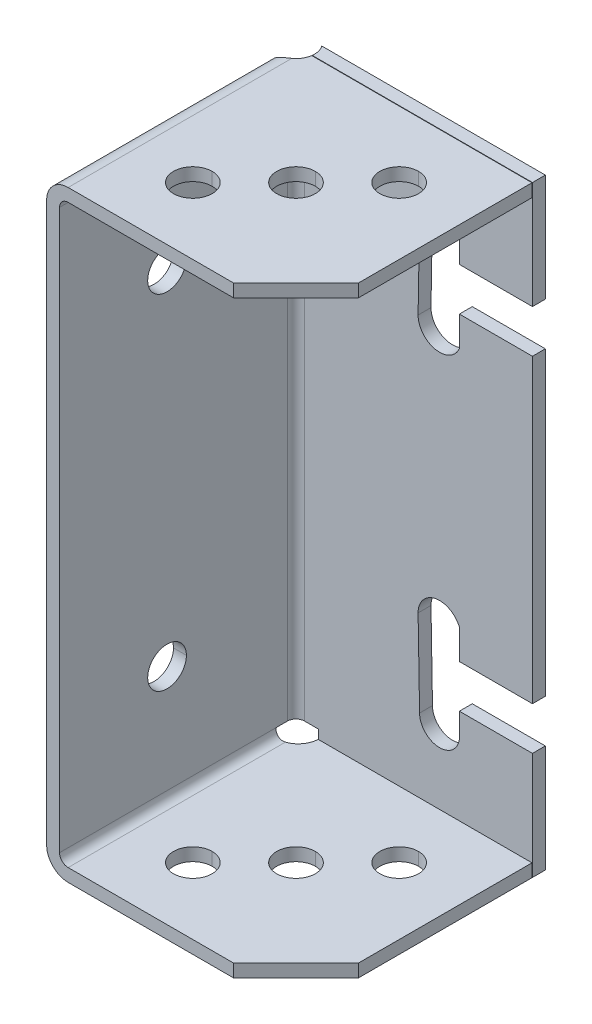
ISO-10303-21;
HEADER;
FILE_DESCRIPTION(('STEP AP214'),'2;1');
FILE_NAME('part.step','',(''),(''),'','','');
FILE_SCHEMA(('AUTOMOTIVE_DESIGN { 1 0 10303 214 1 1 1 1 }'));
ENDSEC;
DATA;
#1=APPLICATION_CONTEXT('core data for automotive mechanical design processes');
#2=APPLICATION_PROTOCOL_DEFINITION('international standard','automotive_design',2000,#1);
#3=PRODUCT_CONTEXT('',#1,'mechanical');
#4=PRODUCT('Part','Part','',(#3));
#5=PRODUCT_RELATED_PRODUCT_CATEGORY('part','',(#4));
#6=PRODUCT_DEFINITION_FORMATION('','',#4);
#7=PRODUCT_DEFINITION_CONTEXT('part definition',#1,'design');
#8=PRODUCT_DEFINITION('design','',#6,#7);
#9=PRODUCT_DEFINITION_SHAPE('','',#8);
#10=(LENGTH_UNIT() NAMED_UNIT(*) SI_UNIT(.MILLI.,.METRE.));
#11=(NAMED_UNIT(*) PLANE_ANGLE_UNIT() SI_UNIT($,.RADIAN.));
#12=(NAMED_UNIT(*) SI_UNIT($,.STERADIAN.) SOLID_ANGLE_UNIT());
#13=UNCERTAINTY_MEASURE_WITH_UNIT(LENGTH_MEASURE(1.E-05),#10,'distance_accuracy_value','');
#14=(GEOMETRIC_REPRESENTATION_CONTEXT(3) GLOBAL_UNCERTAINTY_ASSIGNED_CONTEXT((#13)) GLOBAL_UNIT_ASSIGNED_CONTEXT((#10,
#11,#12)) REPRESENTATION_CONTEXT('',''));
#15=CARTESIAN_POINT('',(0.,0.,0.));
#16=DIRECTION('',(0.,0.,1.));
#17=DIRECTION('',(1.,0.,0.));
#18=AXIS2_PLACEMENT_3D('',#15,#16,#17);
#19=CARTESIAN_POINT('',(3.44081255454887,5.00000000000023,2.90315974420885));
#20=DIRECTION('',(0.,-1.,0.));
#21=DIRECTION('',(-1.,0.,0.));
#22=AXIS2_PLACEMENT_3D('',#19,#20,#21);
#23=PLANE('',#22);
#24=CARTESIAN_POINT('',(4.99999999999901,5.00000000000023,4.99999999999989));
#25=DIRECTION('',(0.,1.,0.));
#26=DIRECTION('',(0.,0.,-1.));
#27=AXIS2_PLACEMENT_3D('',#24,#25,#26);
#28=CIRCLE('',#27,2.);
#29=CARTESIAN_POINT('',(4.99999999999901,5.00000000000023,3.00000000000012));
#30=VERTEX_POINT('',#29);
#31=CARTESIAN_POINT('',(2.99999999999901,5.00000000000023,4.99999999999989));
#32=VERTEX_POINT('',#31);
#33=EDGE_CURVE('E654',#30,#32,#28,.T.);
#34=ORIENTED_EDGE('',*,*,#33,.T.);
#35=DIRECTION('',(0.,0.,1.));
#36=VECTOR('',#35,1.);
#37=CARTESIAN_POINT('',(2.99999999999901,5.00000000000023,3.00000000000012));
#38=LINE('',#37,#36);
#39=CARTESIAN_POINT('',(2.99999999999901,5.00000000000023,7.7060928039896));
#40=VERTEX_POINT('',#39);
#41=EDGE_CURVE('E907',#32,#40,#38,.T.);
#42=ORIENTED_EDGE('',*,*,#41,.T.);
#43=CARTESIAN_POINT('',(3.44081255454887,5.00000000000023,2.90315974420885));
#44=DIRECTION('',(0.,-1.,0.));
#45=DIRECTION('',(0.,0.,-1.));
#46=AXIS2_PLACEMENT_3D('',#43,#44,#45);
#47=CIRCLE('',#46,4.82311949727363);
#48=CARTESIAN_POINT('',(-8.88178419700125E-13,5.00000000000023,6.28299563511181));
#49=VERTEX_POINT('',#48);
#50=EDGE_CURVE('E26',#40,#49,#47,.T.);
#51=ORIENTED_EDGE('',*,*,#50,.T.);
#52=DIRECTION('',(0.,0.,1.));
#53=VECTOR('',#52,1.);
#54=CARTESIAN_POINT('',(0.,5.00000000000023,58.));
#55=LINE('',#54,#53);
#56=CARTESIAN_POINT('',(-8.88178419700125E-13,5.00000000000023,4.99999999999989));
#57=VERTEX_POINT('',#56);
#58=EDGE_CURVE('E981',#57,#49,#55,.T.);
#59=ORIENTED_EDGE('',*,*,#58,.F.);
#60=CARTESIAN_POINT('',(4.99999999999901,5.00000000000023,4.99999999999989));
#61=DIRECTION('',(0.,1.,0.));
#62=DIRECTION('',(0.,0.,-1.));
#63=AXIS2_PLACEMENT_3D('',#60,#61,#62);
#64=CIRCLE('',#63,5.);
#65=CARTESIAN_POINT('',(4.99999999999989,5.,0.));
#66=VERTEX_POINT('',#65);
#67=EDGE_CURVE('E661',#66,#57,#64,.T.);
#68=ORIENTED_EDGE('',*,*,#67,.F.);
#69=DIRECTION('',(-1.,0.,0.));
#70=VECTOR('',#69,1.);
#71=CARTESIAN_POINT('',(0.,5.,0.));
#72=LINE('',#71,#70);
#73=CARTESIAN_POINT('',(7.29232461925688,5.,0.));
#74=VERTEX_POINT('',#73);
#75=EDGE_CURVE('E720',#74,#66,#72,.T.);
#76=ORIENTED_EDGE('',*,*,#75,.F.);
#77=CARTESIAN_POINT('',(3.44081255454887,5.00000000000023,2.90315974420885));
#78=DIRECTION('',(0.,-1.,0.));
#79=DIRECTION('',(0.,0.,-1.));
#80=AXIS2_PLACEMENT_3D('',#77,#78,#79);
#81=CIRCLE('',#80,4.82311949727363);
#82=CARTESIAN_POINT('',(8.26295975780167,5.00000000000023,3.00000000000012));
#83=VERTEX_POINT('',#82);
#84=EDGE_CURVE('E11',#74,#83,#81,.T.);
#85=ORIENTED_EDGE('',*,*,#84,.T.);
#86=DIRECTION('',(1.,0.,0.));
#87=VECTOR('',#86,1.);
#88=CARTESIAN_POINT('',(-8.88178419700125E-13,5.00000000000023,3.00000000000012));
#89=LINE('',#88,#87);
#90=EDGE_CURVE('E643',#30,#83,#89,.T.);
#91=ORIENTED_EDGE('',*,*,#90,.F.);
#92=EDGE_LOOP('',(#34,#42,#51,#59,#68,#76,#85,#91));
#93=FACE_BOUND('',#92,.T.);
#94=ADVANCED_FACE('F16',(#93),#23,.T.);
#95=CARTESIAN_POINT('',(3.44081255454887,5.00000000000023,2.90315974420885));
#96=DIRECTION('',(0.,-1.,0.));
#97=DIRECTION('',(0.,0.,-1.));
#98=AXIS2_PLACEMENT_3D('',#95,#96,#97);
#99=CYLINDRICAL_SURFACE('',#98,4.82311949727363);
#100=DIRECTION('',(0.,-1.,0.));
#101=VECTOR('',#100,1.);
#102=CARTESIAN_POINT('',(7.29232461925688,5.,0.));
#103=LINE('',#102,#101);
#104=CARTESIAN_POINT('',(7.29232461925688,0.,0.));
#105=VERTEX_POINT('',#104);
#106=EDGE_CURVE('E818',#74,#105,#103,.T.);
#107=ORIENTED_EDGE('',*,*,#106,.T.);
#108=CARTESIAN_POINT('',(3.44081255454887,2.22044604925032E-13,2.90315974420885));
#109=DIRECTION('',(0.,-1.,0.));
#110=DIRECTION('',(0.,0.,-1.));
#111=AXIS2_PLACEMENT_3D('',#108,#109,#110);
#112=CIRCLE('',#111,4.82311949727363);
#113=CARTESIAN_POINT('',(8.26295975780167,2.22044604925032E-13,3.00000000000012));
#114=VERTEX_POINT('',#113);
#115=EDGE_CURVE('E561',#105,#114,#112,.T.);
#116=ORIENTED_EDGE('',*,*,#115,.T.);
#117=DIRECTION('',(0.,1.,0.));
#118=VECTOR('',#117,1.);
#119=CARTESIAN_POINT('',(8.26295975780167,5.00000000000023,3.00000000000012));
#120=LINE('',#119,#118);
#121=EDGE_CURVE('E522',#114,#83,#120,.T.);
#122=ORIENTED_EDGE('',*,*,#121,.T.);
#123=ORIENTED_EDGE('',*,*,#84,.F.);
#124=EDGE_LOOP('',(#107,#116,#122,#123));
#125=FACE_BOUND('',#124,.T.);
#126=ADVANCED_FACE('F880',(#125),#99,.F.);
#127=CARTESIAN_POINT('',(3.44081255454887,5.00000000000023,2.90315974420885));
#128=DIRECTION('',(0.,-1.,0.));
#129=DIRECTION('',(0.,0.,-1.));
#130=AXIS2_PLACEMENT_3D('',#127,#128,#129);
#131=CYLINDRICAL_SURFACE('',#130,4.82311949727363);
#132=CARTESIAN_POINT('',(3.44081255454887,2.22044604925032E-13,2.90315974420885));
#133=DIRECTION('',(0.,-1.,0.));
#134=DIRECTION('',(0.,0.,-1.));
#135=AXIS2_PLACEMENT_3D('',#132,#133,#134);
#136=CIRCLE('',#135,4.82311949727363);
#137=CARTESIAN_POINT('',(8.25991367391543,2.22044604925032E-13,3.09999999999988));
#138=VERTEX_POINT('',#137);
#139=CARTESIAN_POINT('',(4.99999999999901,2.22044604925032E-13,7.46730437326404));
#140=VERTEX_POINT('',#139);
#141=EDGE_CURVE('E956',#138,#140,#136,.T.);
#142=ORIENTED_EDGE('',*,*,#141,.T.);
#143=CARTESIAN_POINT('',(4.99999999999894,2.34187669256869E-13,7.46730437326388));
#144=CARTESIAN_POINT('',(4.94583447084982,-1.10533674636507E-06,7.48581033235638));
#145=CARTESIAN_POINT('',(4.89133725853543,0.00089755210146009,7.50334865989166));
#146=CARTESIAN_POINT('',(4.78220620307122,0.00451769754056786,7.53634068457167));
#147=CARTESIAN_POINT('',(4.72757620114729,0.00722595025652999,7.55180854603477));
#148=CARTESIAN_POINT('',(4.6182614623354,0.0144649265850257,7.58068825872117));
#149=CARTESIAN_POINT('',(4.5635792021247,0.0189841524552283,7.59411235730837));
#150=CARTESIAN_POINT('',(4.45424042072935,0.029842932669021,7.6189387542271));
#151=CARTESIAN_POINT('',(4.39958525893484,0.0361728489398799,7.63035125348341));
#152=CARTESIAN_POINT('',(4.29037751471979,0.050651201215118,7.65119074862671));
#153=CARTESIAN_POINT('',(4.23582545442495,0.0587919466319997,7.6606258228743));
#154=CARTESIAN_POINT('',(4.12689761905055,0.0768899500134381,7.67754949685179));
#155=CARTESIAN_POINT('',(4.07252181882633,0.0868415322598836,7.68504400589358));
#156=CARTESIAN_POINT('',(3.96401687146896,0.108559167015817,7.6981278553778));
#157=CARTESIAN_POINT('',(3.90988744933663,0.120321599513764,7.70372092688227));
#158=CARTESIAN_POINT('',(3.80194230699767,0.145658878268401,7.71304532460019));
#159=CARTESIAN_POINT('',(3.74812635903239,0.159232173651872,7.71677823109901));
#160=CARTESIAN_POINT('',(3.6408718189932,0.188189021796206,7.7224276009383));
#161=CARTESIAN_POINT('',(3.5874333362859,0.203573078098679,7.72434355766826));
#162=CARTESIAN_POINT('',(3.4809941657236,0.236149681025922,7.72640601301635));
#163=CARTESIAN_POINT('',(3.42799420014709,0.253344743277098,7.72655001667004));
#164=CARTESIAN_POINT('',(3.32248863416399,0.289540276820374,7.72511697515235));
#165=CARTESIAN_POINT('',(3.2699846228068,0.308545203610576,7.72353557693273));
#166=CARTESIAN_POINT('',(3.16552619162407,0.348362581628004,7.71870155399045));
#167=CARTESIAN_POINT('',(3.11357446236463,0.369181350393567,7.71544287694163));
#168=CARTESIAN_POINT('',(3.01118433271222,0.412223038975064,7.70737704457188));
#169=CARTESIAN_POINT('',(2.96073502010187,0.434423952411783,7.70259076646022));
#170=CARTESIAN_POINT('',(2.8604719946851,0.480529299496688,7.69150428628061));
#171=CARTESIAN_POINT('',(2.81066290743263,0.504441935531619,7.68519639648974));
#172=CARTESIAN_POINT('',(2.71172381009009,0.553973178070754,7.67111774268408));
#173=CARTESIAN_POINT('',(2.66259982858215,0.579601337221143,7.66333825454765));
#174=CARTESIAN_POINT('',(2.5650692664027,0.632561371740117,7.64636780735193));
#175=CARTESIAN_POINT('',(2.51667019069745,0.659903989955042,7.63716727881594));
#176=CARTESIAN_POINT('',(2.42062527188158,0.716291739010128,7.61740649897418));
#177=CARTESIAN_POINT('',(2.37298846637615,0.745348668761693,7.60683602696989));
#178=CARTESIAN_POINT('',(2.27850178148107,0.80516520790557,7.58438758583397));
#179=CARTESIAN_POINT('',(2.2316625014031,0.8359375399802,7.5724989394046));
#180=CARTESIAN_POINT('',(2.14068321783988,0.897895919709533,7.54797353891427));
#181=CARTESIAN_POINT('',(2.09650458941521,0.929039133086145,7.53537168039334));
#182=CARTESIAN_POINT('',(2.00918588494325,0.9927233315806,7.5091355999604));
#183=CARTESIAN_POINT('',(1.9660508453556,1.02526955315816,7.495497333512));
#184=CARTESIAN_POINT('',(1.88083540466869,1.09175994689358,7.46725633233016));
#185=CARTESIAN_POINT('',(1.83876117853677,1.12571016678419,7.45264921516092));
#186=CARTESIAN_POINT('',(1.75567921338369,1.19500754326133,7.42253698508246));
#187=CARTESIAN_POINT('',(1.71467878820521,1.2303614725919,7.40702729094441));
#188=CARTESIAN_POINT('',(1.63375337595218,1.30246542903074,7.37517513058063));
#189=CARTESIAN_POINT('',(1.5938368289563,1.33922287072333,7.35882801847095));
#190=CARTESIAN_POINT('',(1.51508605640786,1.41413401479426,7.32536535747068));
#191=CARTESIAN_POINT('',(1.47626137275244,1.4522956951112,7.30824522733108));
#192=CARTESIAN_POINT('',(1.40052517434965,1.52916953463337,7.27367653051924));
#193=CARTESIAN_POINT('',(1.36359440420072,1.56786634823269,7.25623599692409));
#194=CARTESIAN_POINT('',(1.29118129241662,1.64620795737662,7.22093528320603));
#195=CARTESIAN_POINT('',(1.25569556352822,1.6858501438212,7.20307625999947));
#196=CARTESIAN_POINT('',(1.18615691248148,1.76608246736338,7.16702426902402));
#197=CARTESIAN_POINT('',(1.15210148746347,1.80667073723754,7.14883197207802));
#198=CARTESIAN_POINT('',(1.08540412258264,1.88879427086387,7.11219512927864));
#199=CARTESIAN_POINT('',(1.05276059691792,1.93032838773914,7.09375089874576));
#200=CARTESIAN_POINT('',(0.988865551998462,2.01434301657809,7.05668848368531));
#201=CARTESIAN_POINT('',(0.957613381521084,2.05682307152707,7.03807038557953));
#202=CARTESIAN_POINT('',(0.896477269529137,2.14272862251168,7.00073499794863));
#203=CARTESIAN_POINT('',(0.866593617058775,2.18615431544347,6.98201768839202));
#204=CARTESIAN_POINT('',(0.807359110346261,2.27516901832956,6.94403554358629));
#205=CARTESIAN_POINT('',(0.778048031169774,2.32078436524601,6.9247703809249));
#206=CARTESIAN_POINT('',(0.721232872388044,2.41244350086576,6.8865661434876));
#207=CARTESIAN_POINT('',(0.693711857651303,2.45847628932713,6.86762586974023));
#208=CARTESIAN_POINT('',(0.640428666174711,2.55096931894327,6.83016633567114));
#209=CARTESIAN_POINT('',(0.61465061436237,2.59741946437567,6.81164473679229));
#210=CARTESIAN_POINT('',(0.564804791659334,2.69074627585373,6.77511095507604));
#211=CARTESIAN_POINT('',(0.540722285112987,2.73761379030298,6.75709550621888));
#212=CARTESIAN_POINT('',(0.494218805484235,2.83177449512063,6.72165598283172));
#213=CARTESIAN_POINT('',(0.471784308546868,2.87905950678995,6.70422793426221));
#214=CARTESIAN_POINT('',(0.428528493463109,2.97405373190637,6.67003908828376));
#215=CARTESIAN_POINT('',(0.407694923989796,3.02175576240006,6.65327383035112));
#216=CARTESIAN_POINT('',(0.365209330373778,3.12328146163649,6.61853053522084));
#217=CARTESIAN_POINT('',(0.343721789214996,3.1771984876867,6.60062354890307));
#218=CARTESIAN_POINT('',(0.302921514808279,3.28499754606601,6.56605794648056));
#219=CARTESIAN_POINT('',(0.28357579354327,3.33886161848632,6.54938231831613));
#220=CARTESIAN_POINT('',(0.246986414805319,3.44655312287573,6.5173728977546));
#221=CARTESIAN_POINT('',(0.229711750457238,3.50036451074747,6.50202065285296));
#222=CARTESIAN_POINT('',(0.197196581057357,3.6079486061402,6.47274065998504));
#223=CARTESIAN_POINT('',(0.181927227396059,3.66170731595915,6.45879359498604));
#224=CARTESIAN_POINT('',(0.153359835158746,3.76918395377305,6.43239604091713));
#225=CARTESIAN_POINT('',(0.140035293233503,3.82289001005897,6.41992597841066));
#226=CARTESIAN_POINT('',(0.115300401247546,3.93025914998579,6.39654439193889));
#227=CARTESIAN_POINT('',(0.103866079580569,3.98391251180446,6.38561366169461));
#228=CARTESIAN_POINT('',(0.0828606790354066,4.09117406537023,6.36536297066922));
#229=CARTESIAN_POINT('',(0.0732683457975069,4.14477464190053,6.35602479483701));
#230=CARTESIAN_POINT('',(0.0559025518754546,4.25192847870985,6.33900203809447));
#231=CARTESIAN_POINT('',(0.0481107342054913,4.3054761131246,6.33130083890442));
#232=CARTESIAN_POINT('',(0.0343085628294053,4.41252207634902,6.31758593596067));
#233=CARTESIAN_POINT('',(0.0282829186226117,4.46601657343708,6.31155777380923));
#234=CARTESIAN_POINT('',(0.0179827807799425,4.57295440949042,6.30121368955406));
#235=CARTESIAN_POINT('',(0.0136962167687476,4.6263954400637,6.29688597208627));
#236=CARTESIAN_POINT('',(0.00685180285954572,4.73322507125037,6.28996062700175));
#237=CARTESIAN_POINT('',(0.00428522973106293,4.7866125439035,6.28735427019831));
#238=CARTESIAN_POINT('',(0.000864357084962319,4.89333308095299,6.28387550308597));
#239=CARTESIAN_POINT('',(4.78827725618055E-06,4.94666580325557,6.28299775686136));
#240=CARTESIAN_POINT('',(-7.51568945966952E-13,5.00000000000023,6.28299563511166));
#241=B_SPLINE_CURVE_WITH_KNOTS('',3,(#143,#144,#145,#146,#147,#148,#149,#150,#151,#152,#153,
#154,#155,#156,#157,#158,#159,#160,#161,#162,#163,#164,#165,#166,#167,#168,#169,#170,#171,#172,
#173,#174,#175,#176,#177,#178,#179,#180,#181,#182,#183,#184,#185,#186,#187,#188,#189,#190,#191,
#192,#193,#194,#195,#196,#197,#198,#199,#200,#201,#202,#203,#204,#205,#206,#207,#208,#209,#210,
#211,#212,#213,#214,#215,#216,#217,#218,#219,#220,#221,#222,#223,#224,#225,#226,#227,#228,#229,
#230,#231,#232,#233,#234,#235,#236,#237,#238,#239,#240),.UNSPECIFIED.,.F.,.F.,(4,2,2,2,2,2,2,2,
2,2,2,2,2,2,2,2,2,2,2,2,2,2,2,2,2,2,2,2,2,2,2,2,2,2,2,2,2,2,2,2,2,2,2,2,2,2,2,2,4),(0.,
0.171704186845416,0.342166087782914,0.511562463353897,0.68007342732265,0.847881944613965,
1.0151732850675,1.18213444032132,1.34895351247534,1.51581908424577,1.68291958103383,
1.85044263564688,2.01857446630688,2.18450038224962,2.35128285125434,2.51908694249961,
2.68807473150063,2.85840491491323,3.03023247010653,3.19670111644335,3.36385652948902,
3.5318277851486,3.70074208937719,3.87072453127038,4.04189785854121,4.21065796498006,
4.37899657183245,4.54702716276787,4.7148638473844,4.88262113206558,5.05041368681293,
5.22301209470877,5.39362089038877,5.56237394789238,5.72940960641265,5.89487051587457,
6.0589034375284,6.24108533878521,6.41988257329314,6.59553258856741,6.76828581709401,
6.93840549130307,7.10616724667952,7.27185849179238,7.43577753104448,7.59823243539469,
7.75953966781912,7.92002248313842,8.08000913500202),.UNSPECIFIED.);
#242=EDGE_CURVE('E862',#140,#49,#241,.T.);
#243=ORIENTED_EDGE('',*,*,#242,.T.);
#244=ORIENTED_EDGE('',*,*,#50,.F.);
#245=CARTESIAN_POINT('',(4.99999999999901,3.00000000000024,7.46730437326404));
#246=CARTESIAN_POINT('',(4.97490273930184,2.99999957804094,7.47587818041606));
#247=CARTESIAN_POINT('',(4.94973175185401,3.00047239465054,7.48423750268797));
#248=CARTESIAN_POINT('',(4.89932777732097,3.00237649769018,7.50050934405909));
#249=CARTESIAN_POINT('',(4.87409496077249,3.00380620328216,7.50842257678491));
#250=CARTESIAN_POINT('',(4.8236040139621,3.00763339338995,7.52380226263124));
#251=CARTESIAN_POINT('',(4.79834596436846,3.01002956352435,7.5312693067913));
#252=CARTESIAN_POINT('',(4.74784232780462,3.01579694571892,7.54575676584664));
#253=CARTESIAN_POINT('',(4.72259675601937,3.01916712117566,7.55277764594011));
#254=CARTESIAN_POINT('',(4.67215642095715,3.02688848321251,7.56637289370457));
#255=CARTESIAN_POINT('',(4.64696163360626,3.03123891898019,7.57294759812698));
#256=CARTESIAN_POINT('',(4.5966618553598,3.04092521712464,7.58565063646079));
#257=CARTESIAN_POINT('',(4.57155682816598,3.04626062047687,7.5917791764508));
#258=CARTESIAN_POINT('',(4.52147610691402,3.05791972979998,7.60358997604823));
#259=CARTESIAN_POINT('',(4.49650039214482,3.0642432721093,7.60927230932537));
#260=CARTESIAN_POINT('',(4.4467183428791,3.0778799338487,7.62019098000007));
#261=CARTESIAN_POINT('',(4.42191203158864,3.08519318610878,7.62542725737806));
#262=CARTESIAN_POINT('',(4.37250923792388,3.10080892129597,7.63545338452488));
#263=CARTESIAN_POINT('',(4.34791285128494,3.10911183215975,7.64024303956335));
#264=CARTESIAN_POINT('',(4.29897086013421,3.12670481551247,7.6493781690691));
#265=CARTESIAN_POINT('',(4.27462545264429,3.13599560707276,7.653723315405));
#266=CARTESIAN_POINT('',(4.22829504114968,3.15472443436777,7.66160951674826));
#267=CARTESIAN_POINT('',(4.20628442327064,3.16408368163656,7.66518749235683));
#268=CARTESIAN_POINT('',(4.16213572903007,3.18380084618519,7.67204217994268));
#269=CARTESIAN_POINT('',(4.14000367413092,3.19417479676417,7.67531157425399));
#270=CARTESIAN_POINT('',(4.0956657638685,3.21595920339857,7.68155078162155));
#271=CARTESIAN_POINT('',(4.07346691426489,3.22738594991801,7.6845134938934));
#272=CARTESIAN_POINT('',(4.02905237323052,3.25131213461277,7.6901386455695));
#273=CARTESIAN_POINT('',(4.00684468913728,3.26382806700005,7.69279415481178));
#274=CARTESIAN_POINT('',(3.96247346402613,3.28996655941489,7.6978048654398));
#275=CARTESIAN_POINT('',(3.94031896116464,3.30360575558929,7.70015332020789));
#276=CARTESIAN_POINT('',(3.89611893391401,3.33202219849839,7.70454969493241));
#277=CARTESIAN_POINT('',(3.87408350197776,3.34681616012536,7.70659104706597));
#278=CARTESIAN_POINT('',(3.83019035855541,3.37757065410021,7.71037308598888));
#279=CARTESIAN_POINT('',(3.80834381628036,3.39354791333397,7.71210738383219));
#280=CARTESIAN_POINT('',(3.76490101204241,3.42669429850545,7.71527499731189));
#281=CARTESIAN_POINT('',(3.74331701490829,3.44388009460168,7.71670209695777));
#282=CARTESIAN_POINT('',(3.70047578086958,3.4794650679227,7.71925567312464));
#283=CARTESIAN_POINT('',(3.6792319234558,3.49788078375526,7.72037611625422));
#284=CARTESIAN_POINT('',(3.63715066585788,3.53594358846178,7.72231417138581));
#285=CARTESIAN_POINT('',(3.6163277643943,3.55560701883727,7.72312588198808));
#286=CARTESIAN_POINT('',(3.57885044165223,3.59255212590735,7.72433544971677));
#287=CARTESIAN_POINT('',(3.56206784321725,3.60970260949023,7.72477908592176));
#288=CARTESIAN_POINT('',(3.52831207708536,3.64546362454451,7.72550397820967));
#289=CARTESIAN_POINT('',(3.51137071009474,3.66410438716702,7.72577609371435));
#290=CARTESIAN_POINT('',(3.47741920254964,3.70290962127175,7.7261552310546));
#291=CARTESIAN_POINT('',(3.46044369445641,3.72310446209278,7.72625383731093));
#292=CARTESIAN_POINT('',(3.42655520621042,3.76507835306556,7.72628610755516));
#293=CARTESIAN_POINT('',(3.40967973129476,3.78688775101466,7.72621211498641));
#294=CARTESIAN_POINT('',(3.38478853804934,3.820468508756,7.72597807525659));
#295=CARTESIAN_POINT('',(3.37643594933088,3.83199215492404,7.72587697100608));
#296=CARTESIAN_POINT('',(3.35980615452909,3.85545849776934,7.72563403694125));
#297=CARTESIAN_POINT('',(3.35153420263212,3.8674049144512,7.72549139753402));
#298=CARTESIAN_POINT('',(3.33237916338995,3.89572322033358,7.7251015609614));
#299=CARTESIAN_POINT('',(3.32160508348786,3.91216869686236,7.7248352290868));
#300=CARTESIAN_POINT('',(3.29874376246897,3.94821231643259,7.72419375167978));
#301=CARTESIAN_POINT('',(3.2867476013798,3.96786807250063,7.72380778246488));
#302=CARTESIAN_POINT('',(3.26173758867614,4.01048486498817,7.72292601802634));
#303=CARTESIAN_POINT('',(3.2488313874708,4.03350897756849,7.7224224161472));
#304=CARTESIAN_POINT('',(3.2223529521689,4.08301780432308,7.72130491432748));
#305=CARTESIAN_POINT('',(3.20890575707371,4.10956932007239,7.72068513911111));
#306=CARTESIAN_POINT('',(3.18175617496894,4.16628160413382,7.71932288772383));
#307=CARTESIAN_POINT('',(3.16819700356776,4.1965108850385,7.71857446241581));
#308=CARTESIAN_POINT('',(3.14249798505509,4.25784083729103,7.71707351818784));
#309=CARTESIAN_POINT('',(3.130369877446,4.28894642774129,7.71632101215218));
#310=CARTESIAN_POINT('',(3.10820820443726,4.35027896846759,7.71490714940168));
#311=CARTESIAN_POINT('',(3.09810384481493,4.38048029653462,7.71424318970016));
#312=CARTESIAN_POINT('',(3.07980154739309,4.43986077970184,7.71299298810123));
#313=CARTESIAN_POINT('',(3.0715350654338,4.46901877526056,7.71240454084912));
#314=CARTESIAN_POINT('',(3.0567212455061,4.5261911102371,7.71130899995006));
#315=CARTESIAN_POINT('',(3.05010791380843,4.55418831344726,7.71079929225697));
#316=CARTESIAN_POINT('',(3.03841615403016,4.60893750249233,7.70986064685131));
#317=CARTESIAN_POINT('',(3.03327452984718,4.63567595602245,7.70942884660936));
#318=CARTESIAN_POINT('',(3.02434670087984,4.68782422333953,7.70864654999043));
#319=CARTESIAN_POINT('',(3.02050030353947,4.71322369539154,7.7082928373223));
#320=CARTESIAN_POINT('',(3.01398968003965,4.76262682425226,7.70766699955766));
#321=CARTESIAN_POINT('',(3.01126843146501,4.78662293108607,7.70739125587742));
#322=CARTESIAN_POINT('',(3.00684227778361,4.83316654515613,7.70692193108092));
#323=CARTESIAN_POINT('',(3.00508365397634,4.85570891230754,7.70672423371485));
#324=CARTESIAN_POINT('',(3.00242537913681,4.8993048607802,7.70641112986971));
#325=CARTESIAN_POINT('',(3.00147541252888,4.920355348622,7.70629103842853));
#326=CARTESIAN_POINT('',(3.00028608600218,4.96093814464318,7.70613515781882));
#327=CARTESIAN_POINT('',(2.99999990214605,4.98046906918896,7.70609385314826));
#328=CARTESIAN_POINT('',(2.99999999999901,5.00000000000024,7.70609280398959));
#329=B_SPLINE_CURVE_WITH_KNOTS('',3,(#245,#246,#247,#248,#249,#250,#251,#252,#253,#254,#255,
#256,#257,#258,#259,#260,#261,#262,#263,#264,#265,#266,#267,#268,#269,#270,#271,#272,#273,#274,
#275,#276,#277,#278,#279,#280,#281,#282,#283,#284,#285,#286,#287,#288,#289,#290,#291,#292,#293,
#294,#295,#296,#297,#298,#299,#300,#301,#302,#303,#304,#305,#306,#307,#308,#309,#310,#311,#312,
#313,#314,#315,#316,#317,#318,#319,#320,#321,#322,#323,#324,#325,#326,#327,#328),.UNSPECIFIED.,
.F.,.F.,(4,2,2,2,2,2,2,2,2,2,2,2,2,2,2,2,2,2,2,2,2,2,2,2,2,2,2,2,2,2,2,2,2,2,2,2,2,2,2,2,2,4),
(0.,0.0795595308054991,0.158987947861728,0.238308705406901,0.317545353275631,0.39672151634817,
0.47586087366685,0.554987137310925,0.634124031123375,0.713295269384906,0.792524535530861,
0.865058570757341,0.939020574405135,1.01442756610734,1.09129560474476,1.16963984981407,
1.24947461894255,1.33081344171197,1.41366910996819,1.49805372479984,1.583978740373,
1.65596260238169,1.73151515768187,1.81064049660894,1.8933421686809,1.93603758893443,
1.97962837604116,2.0386064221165,2.10768426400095,2.18686199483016,2.27613946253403,
2.37551634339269,2.47565884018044,2.57118368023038,2.66209093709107,2.74838072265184,
2.8300531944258,2.9071085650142,2.97954711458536,3.0473692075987,3.11057531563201,
3.16916604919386),.UNSPECIFIED.);
#330=CARTESIAN_POINT('',(4.99999999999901,3.00000000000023,7.46730437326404));
#331=VERTEX_POINT('',#330);
#332=EDGE_CURVE('E731',#331,#40,#329,.T.);
#333=ORIENTED_EDGE('',*,*,#332,.F.);
#334=CARTESIAN_POINT('',(3.44081255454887,3.00000000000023,2.90315974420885));
#335=DIRECTION('',(0.,-1.,0.));
#336=DIRECTION('',(0.,0.,-1.));
#337=AXIS2_PLACEMENT_3D('',#334,#335,#336);
#338=CIRCLE('',#337,4.82311949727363);
#339=CARTESIAN_POINT('',(8.25991367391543,3.00000000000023,3.09999999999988));
#340=VERTEX_POINT('',#339);
#341=EDGE_CURVE('E829',#340,#331,#338,.T.);
#342=ORIENTED_EDGE('',*,*,#341,.F.);
#343=DIRECTION('',(0.,1.,0.));
#344=VECTOR('',#343,1.);
#345=CARTESIAN_POINT('',(8.25991367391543,5.00000000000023,3.09999999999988));
#346=LINE('',#345,#344);
#347=EDGE_CURVE('E727',#138,#340,#346,.T.);
#348=ORIENTED_EDGE('',*,*,#347,.F.);
#349=EDGE_LOOP('',(#142,#243,#244,#333,#342,#348));
#350=FACE_BOUND('',#349,.T.);
#351=ADVANCED_FACE('F869',(#350),#131,.F.);
#352=CARTESIAN_POINT('',(2.53093856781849,135.,2.48958065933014));
#353=DIRECTION('',(0.,1.,0.));
#354=DIRECTION('',(0.,0.,-1.));
#355=AXIS2_PLACEMENT_3D('',#352,#353,#354);
#356=PLANE('',#355);
#357=CARTESIAN_POINT('',(4.99999999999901,135.,4.99999999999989));
#358=DIRECTION('',(0.,-1.,0.));
#359=DIRECTION('',(0.,0.,1.));
#360=AXIS2_PLACEMENT_3D('',#357,#358,#359);
#361=CIRCLE('',#360,5.);
#362=CARTESIAN_POINT('',(-8.88178419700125E-13,135.,4.99999999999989));
#363=VERTEX_POINT('',#362);
#364=CARTESIAN_POINT('',(4.99999999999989,135.,0.));
#365=VERTEX_POINT('',#364);
#366=EDGE_CURVE('E651',#363,#365,#361,.T.);
#367=ORIENTED_EDGE('',*,*,#366,.F.);
#368=DIRECTION('',(0.,0.,-1.));
#369=VECTOR('',#368,1.);
#370=CARTESIAN_POINT('',(0.,135.,58.));
#371=LINE('',#370,#369);
#372=CARTESIAN_POINT('',(-8.88178419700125E-13,135.,5.92877103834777));
#373=VERTEX_POINT('',#372);
#374=EDGE_CURVE('E987',#373,#363,#371,.T.);
#375=ORIENTED_EDGE('',*,*,#374,.F.);
#376=CARTESIAN_POINT('',(2.53093856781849,135.,2.48958065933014));
#377=DIRECTION('',(0.,1.,0.));
#378=DIRECTION('',(0.,0.,1.));
#379=AXIS2_PLACEMENT_3D('',#376,#377,#378);
#380=CIRCLE('',#379,4.27009139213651);
#381=CARTESIAN_POINT('',(2.5309385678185,135.,6.75967205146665));
#382=VERTEX_POINT('',#381);
#383=EDGE_CURVE('E1013',#373,#382,#380,.T.);
#384=ORIENTED_EDGE('',*,*,#383,.T.);
#385=CARTESIAN_POINT('',(2.53093856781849,135.,2.48958065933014));
#386=DIRECTION('',(0.,1.,0.));
#387=DIRECTION('',(0.,0.,1.));
#388=AXIS2_PLACEMENT_3D('',#385,#386,#387);
#389=CIRCLE('',#388,4.27009139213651);
#390=CARTESIAN_POINT('',(2.99999999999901,135.,6.73383110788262));
#391=VERTEX_POINT('',#390);
#392=EDGE_CURVE('E1069',#382,#391,#389,.T.);
#393=ORIENTED_EDGE('',*,*,#392,.T.);
#394=DIRECTION('',(0.,0.,1.));
#395=VECTOR('',#394,1.);
#396=CARTESIAN_POINT('',(3.00000000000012,135.,58.));
#397=LINE('',#396,#395);
#398=CARTESIAN_POINT('',(2.99999999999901,135.,4.99999999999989));
#399=VERTEX_POINT('',#398);
#400=EDGE_CURVE('E911',#399,#391,#397,.T.);
#401=ORIENTED_EDGE('',*,*,#400,.F.);
#402=CARTESIAN_POINT('',(4.99999999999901,135.,4.99999999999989));
#403=DIRECTION('',(0.,-1.,0.));
#404=DIRECTION('',(0.,0.,1.));
#405=AXIS2_PLACEMENT_3D('',#402,#403,#404);
#406=CIRCLE('',#405,2.);
#407=CARTESIAN_POINT('',(4.99999999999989,135.,3.00000000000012));
#408=VERTEX_POINT('',#407);
#409=EDGE_CURVE('E679',#399,#408,#406,.T.);
#410=ORIENTED_EDGE('',*,*,#409,.T.);
#411=DIRECTION('',(-1.,0.,0.));
#412=VECTOR('',#411,1.);
#413=CARTESIAN_POINT('',(0.,135.,3.00000000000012));
#414=LINE('',#413,#412);
#415=CARTESIAN_POINT('',(6.77041407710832,135.,3.00000000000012));
#416=VERTEX_POINT('',#415);
#417=EDGE_CURVE('E640',#416,#408,#414,.T.);
#418=ORIENTED_EDGE('',*,*,#417,.F.);
#419=CARTESIAN_POINT('',(2.53093856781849,135.,2.48958065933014));
#420=DIRECTION('',(0.,1.,0.));
#421=DIRECTION('',(0.,0.,1.));
#422=AXIS2_PLACEMENT_3D('',#419,#420,#421);
#423=CIRCLE('',#422,4.27009139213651);
#424=CARTESIAN_POINT('',(6.00018468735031,135.,0.));
#425=VERTEX_POINT('',#424);
#426=EDGE_CURVE('E40',#416,#425,#423,.T.);
#427=ORIENTED_EDGE('',*,*,#426,.T.);
#428=DIRECTION('',(1.,0.,0.));
#429=VECTOR('',#428,1.);
#430=CARTESIAN_POINT('',(0.,135.,0.));
#431=LINE('',#430,#429);
#432=EDGE_CURVE('E716',#365,#425,#431,.T.);
#433=ORIENTED_EDGE('',*,*,#432,.F.);
#434=EDGE_LOOP('',(#367,#375,#384,#393,#401,#410,#418,#427,#433));
#435=FACE_BOUND('',#434,.T.);
#436=ADVANCED_FACE('F879',(#435),#356,.T.);
#437=CARTESIAN_POINT('',(2.53093856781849,135.,2.48958065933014));
#438=DIRECTION('',(0.,1.,0.));
#439=DIRECTION('',(0.,0.,1.));
#440=AXIS2_PLACEMENT_3D('',#437,#438,#439);
#441=CYLINDRICAL_SURFACE('',#440,4.27009139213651);
#442=DIRECTION('',(0.,-1.,0.));
#443=VECTOR('',#442,1.);
#444=CARTESIAN_POINT('',(6.00018468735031,135.,0.));
#445=LINE('',#444,#443);
#446=CARTESIAN_POINT('',(6.00018468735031,140.,0.));
#447=VERTEX_POINT('',#446);
#448=EDGE_CURVE('E712',#447,#425,#445,.T.);
#449=ORIENTED_EDGE('',*,*,#448,.T.);
#450=ORIENTED_EDGE('',*,*,#426,.F.);
#451=DIRECTION('',(0.,1.,0.));
#452=VECTOR('',#451,1.);
#453=CARTESIAN_POINT('',(6.77041407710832,135.,3.00000000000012));
#454=LINE('',#453,#452);
#455=CARTESIAN_POINT('',(6.77041407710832,140.,3.00000000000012));
#456=VERTEX_POINT('',#455);
#457=EDGE_CURVE('E644',#416,#456,#454,.T.);
#458=ORIENTED_EDGE('',*,*,#457,.T.);
#459=CARTESIAN_POINT('',(2.53093856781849,140.,2.48958065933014));
#460=DIRECTION('',(0.,1.,0.));
#461=DIRECTION('',(0.,0.,1.));
#462=AXIS2_PLACEMENT_3D('',#459,#460,#461);
#463=CIRCLE('',#462,4.27009139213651);
#464=EDGE_CURVE('E762',#456,#447,#463,.T.);
#465=ORIENTED_EDGE('',*,*,#464,.T.);
#466=EDGE_LOOP('',(#449,#450,#458,#465));
#467=FACE_BOUND('',#466,.T.);
#468=ADVANCED_FACE('F1101',(#467),#441,.F.);
#469=CARTESIAN_POINT('',(2.53093856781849,135.,2.48958065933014));
#470=DIRECTION('',(0.,1.,0.));
#471=DIRECTION('',(0.,0.,1.));
#472=AXIS2_PLACEMENT_3D('',#469,#470,#471);
#473=CYLINDRICAL_SURFACE('',#472,4.27009139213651);
#474=DIRECTION('',(0.,1.,0.));
#475=VECTOR('',#474,1.);
#476=CARTESIAN_POINT('',(2.53093856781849,135.,6.75967205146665));
#477=LINE('',#476,#475);
#478=CARTESIAN_POINT('',(2.53093856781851,139.34784264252,6.75967205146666));
#479=VERTEX_POINT('',#478);
#480=EDGE_CURVE('E1061',#382,#479,#477,.T.);
#481=ORIENTED_EDGE('',*,*,#480,.F.);
#482=ORIENTED_EDGE('',*,*,#383,.F.);
#483=CARTESIAN_POINT('',(-5.45570533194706E-13,135.,5.92877103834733));
#484=CARTESIAN_POINT('',(4.9677780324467E-06,135.054774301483,5.92877239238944));
#485=CARTESIAN_POINT('',(0.000908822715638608,135.109547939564,5.929439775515));
#486=CARTESIAN_POINT('',(0.00451111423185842,135.219078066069,5.93208760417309));
#487=CARTESIAN_POINT('',(0.00721195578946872,135.27383443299,5.93406980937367));
#488=CARTESIAN_POINT('',(0.0144157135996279,135.383329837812,5.93933601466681));
#489=CARTESIAN_POINT('',(0.018923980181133,135.438068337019,5.94262387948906));
#490=CARTESIAN_POINT('',(0.0297546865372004,135.54752856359,5.95047720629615));
#491=CARTESIAN_POINT('',(0.0360853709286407,135.60224905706,5.9550484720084));
#492=CARTESIAN_POINT('',(0.0505792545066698,135.711674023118,5.96543710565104));
#493=CARTESIAN_POINT('',(0.0587535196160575,135.766376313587,5.97126198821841));
#494=CARTESIAN_POINT('',(0.076958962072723,135.875765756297,5.98411777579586));
#495=CARTESIAN_POINT('',(0.0870039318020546,135.930449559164,5.99115760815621));
#496=CARTESIAN_POINT('',(0.10897906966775,136.039803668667,6.00639357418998));
#497=CARTESIAN_POINT('',(0.12092562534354,136.09446928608,6.01459968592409));
#498=CARTESIAN_POINT('',(0.146743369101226,136.203786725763,6.0321135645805));
#499=CARTESIAN_POINT('',(0.160633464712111,136.25843236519,6.0414320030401));
#500=CARTESIAN_POINT('',(0.189456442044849,136.364397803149,6.06049449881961));
#501=CARTESIAN_POINT('',(0.204304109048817,136.41574871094,6.07019489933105));
#502=CARTESIAN_POINT('',(0.235665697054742,136.518110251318,6.09037955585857));
#503=CARTESIAN_POINT('',(0.252188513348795,136.569117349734,6.10086791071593));
#504=CARTESIAN_POINT('',(0.286940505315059,136.670790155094,6.12256503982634));
#505=CARTESIAN_POINT('',(0.305180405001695,136.721451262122,6.13377818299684));
#506=CARTESIAN_POINT('',(0.343402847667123,136.822433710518,6.15685078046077));
#507=CARTESIAN_POINT('',(0.363397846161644,136.872749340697,6.16871458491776));
#508=CARTESIAN_POINT('',(0.405169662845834,136.973041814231,6.19300824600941));
#509=CARTESIAN_POINT('',(0.426960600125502,137.023011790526,6.20544216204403));
#510=CARTESIAN_POINT('',(0.472364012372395,137.122614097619,6.23078818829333));
#511=CARTESIAN_POINT('',(0.495992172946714,137.172238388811,6.24370377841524));
#512=CARTESIAN_POINT('',(0.545109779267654,137.271150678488,6.26991764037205));
#513=CARTESIAN_POINT('',(0.5706163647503,137.320429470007,6.28321852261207));
#514=CARTESIAN_POINT('',(0.623531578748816,137.418651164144,6.3101002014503));
#515=CARTESIAN_POINT('',(0.650958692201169,137.467583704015,6.3236824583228));
#516=CARTESIAN_POINT('',(0.706484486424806,137.562944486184,6.35040524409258));
#517=CARTESIAN_POINT('',(0.734532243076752,137.609402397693,6.36354575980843));
#518=CARTESIAN_POINT('',(0.79205538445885,137.701300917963,6.38970393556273));
#519=CARTESIAN_POINT('',(0.821527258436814,137.746743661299,6.40272181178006));
#520=CARTESIAN_POINT('',(0.88191743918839,137.836611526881,6.42855091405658));
#521=CARTESIAN_POINT('',(0.912833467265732,137.881038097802,6.44136242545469));
#522=CARTESIAN_POINT('',(0.976126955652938,137.968874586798,6.46669046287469));
#523=CARTESIAN_POINT('',(1.00850338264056,138.012285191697,6.47920718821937));
#524=CARTESIAN_POINT('',(1.07473011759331,138.098090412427,6.50385343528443));
#525=CARTESIAN_POINT('',(1.10858062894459,138.1404848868,6.51598290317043));
#526=CARTESIAN_POINT('',(1.17776432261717,138.224258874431,6.53975832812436));
#527=CARTESIAN_POINT('',(1.21309891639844,138.265637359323,6.55140380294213));
#528=CARTESIAN_POINT('',(1.28525665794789,138.347379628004,6.57411125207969));
#529=CARTESIAN_POINT('',(1.32208237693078,138.387741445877,6.5851721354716));
#530=CARTESIAN_POINT('',(1.39722090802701,138.467453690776,6.60660568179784));
#531=CARTESIAN_POINT('',(1.43553737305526,138.5068011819,6.61697646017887));
#532=CARTESIAN_POINT('',(1.51437633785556,138.585186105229,6.63710680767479));
#533=CARTESIAN_POINT('',(1.55492868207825,138.624198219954,6.64684819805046));
#534=CARTESIAN_POINT('',(1.63709525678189,138.700617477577,6.66528204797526));
#535=CARTESIAN_POINT('',(1.67869762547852,138.738035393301,6.67398267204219));
#536=CARTESIAN_POINT('',(1.76293776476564,138.811269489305,6.69025698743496));
#537=CARTESIAN_POINT('',(1.80556526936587,138.847095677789,6.69783873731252));
#538=CARTESIAN_POINT('',(1.89182792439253,138.917146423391,6.7117973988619));
#539=CARTESIAN_POINT('',(1.93545440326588,138.951380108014,6.71818204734));
#540=CARTESIAN_POINT('',(2.0236820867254,139.01824693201,6.7296677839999));
#541=CARTESIAN_POINT('',(2.06827620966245,139.05088817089,6.7347760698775));
#542=CARTESIAN_POINT('',(2.1584016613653,139.114571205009,6.74363016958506));
#543=CARTESIAN_POINT('',(2.20392745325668,139.145619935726,6.74738241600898));
#544=CARTESIAN_POINT('',(2.29587472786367,139.206118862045,6.7534450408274));
#545=CARTESIAN_POINT('',(2.34229213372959,139.235574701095,6.75576086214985));
#546=CARTESIAN_POINT('',(2.4359732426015,139.292890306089,6.7588726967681));
#547=CARTESIAN_POINT('',(2.48323421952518,139.320754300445,6.75967293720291));
#548=CARTESIAN_POINT('',(2.53093856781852,139.34784264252,6.75967205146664));
#549=B_SPLINE_CURVE_WITH_KNOTS('',3,(#483,#484,#485,#486,#487,#488,#489,#490,#491,#492,#493,
#494,#495,#496,#497,#498,#499,#500,#501,#502,#503,#504,#505,#506,#507,#508,#509,#510,#511,#512,
#513,#514,#515,#516,#517,#518,#519,#520,#521,#522,#523,#524,#525,#526,#527,#528,#529,#530,#531,
#532,#533,#534,#535,#536,#537,#538,#539,#540,#541,#542,#543,#544,#545,#546,#547,#548),
.UNSPECIFIED.,.F.,.F.,(4,2,2,2,2,2,2,2,2,2,2,2,2,2,2,2,2,2,2,2,2,2,2,2,2,2,2,2,2,2,2,2,4),(0.,
0.164310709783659,0.328841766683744,0.493863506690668,0.659643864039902,0.826447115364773,
0.994532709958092,1.1641542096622,1.33555835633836,1.49850903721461,1.66237548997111,
1.82734350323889,1.99359516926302,2.161308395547,2.33065647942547,2.50180774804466,
2.6749252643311,2.84240741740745,3.00949588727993,3.17632907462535,3.34304601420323,
3.5097860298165,3.67668838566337,3.84389193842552,4.01153479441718,4.18282055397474,
4.35265960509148,4.52120849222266,4.68862737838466,4.85507968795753,5.02073170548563,
5.18575213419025,5.35031161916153),.UNSPECIFIED.);
#550=EDGE_CURVE('E995',#373,#479,#549,.T.);
#551=ORIENTED_EDGE('',*,*,#550,.T.);
#552=EDGE_LOOP('',(#481,#482,#551));
#553=FACE_BOUND('',#552,.T.);
#554=ADVANCED_FACE('F881',(#553),#473,.F.);
#555=CARTESIAN_POINT('',(4.99999999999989,5.00000000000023,58.));
#556=DIRECTION('',(0.,0.,-1.));
#557=DIRECTION('',(-1.,0.,0.));
#558=AXIS2_PLACEMENT_3D('',#555,#556,#557);
#559=CYLINDRICAL_SURFACE('',#558,5.);
#560=ORIENTED_EDGE('',*,*,#242,.F.);
#561=DIRECTION('',(0.,0.,-1.));
#562=VECTOR('',#561,1.);
#563=CARTESIAN_POINT('',(4.99999999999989,2.22044604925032E-13,58.));
#564=LINE('',#563,#562);
#565=CARTESIAN_POINT('',(4.99999999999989,2.22044604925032E-13,58.));
#566=VERTEX_POINT('',#565);
#567=EDGE_CURVE('E678',#566,#140,#564,.T.);
#568=ORIENTED_EDGE('',*,*,#567,.F.);
#569=CARTESIAN_POINT('',(4.99999999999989,5.00000000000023,58.));
#570=DIRECTION('',(0.,0.,1.));
#571=DIRECTION('',(-1.,0.,0.));
#572=AXIS2_PLACEMENT_3D('',#569,#570,#571);
#573=CIRCLE('',#572,5.);
#574=CARTESIAN_POINT('',(0.,5.00000000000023,58.));
#575=VERTEX_POINT('',#574);
#576=EDGE_CURVE('E687',#575,#566,#573,.T.);
#577=ORIENTED_EDGE('',*,*,#576,.F.);
#578=DIRECTION('',(0.,0.,1.));
#579=VECTOR('',#578,1.);
#580=CARTESIAN_POINT('',(0.,5.00000000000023,58.));
#581=LINE('',#580,#579);
#582=EDGE_CURVE('E976',#49,#575,#581,.T.);
#583=ORIENTED_EDGE('',*,*,#582,.F.);
#584=EDGE_LOOP('',(#560,#568,#577,#583));
#585=FACE_BOUND('',#584,.T.);
#586=ADVANCED_FACE('F947',(#585),#559,.T.);
#587=CARTESIAN_POINT('',(4.99999999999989,135.,58.));
#588=DIRECTION('',(0.,0.,-1.));
#589=DIRECTION('',(-1.,0.,0.));
#590=AXIS2_PLACEMENT_3D('',#587,#588,#589);
#591=CYLINDRICAL_SURFACE('',#590,5.);
#592=ORIENTED_EDGE('',*,*,#550,.F.);
#593=DIRECTION('',(0.,0.,-1.));
#594=VECTOR('',#593,1.);
#595=CARTESIAN_POINT('',(0.,135.,58.));
#596=LINE('',#595,#594);
#597=CARTESIAN_POINT('',(0.,135.,58.));
#598=VERTEX_POINT('',#597);
#599=EDGE_CURVE('E792',#598,#373,#596,.T.);
#600=ORIENTED_EDGE('',*,*,#599,.F.);
#601=CARTESIAN_POINT('',(4.99999999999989,135.,58.));
#602=DIRECTION('',(0.,0.,1.));
#603=DIRECTION('',(-1.,0.,0.));
#604=AXIS2_PLACEMENT_3D('',#601,#602,#603);
#605=CIRCLE('',#604,5.);
#606=CARTESIAN_POINT('',(4.99999999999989,140.,58.));
#607=VERTEX_POINT('',#606);
#608=EDGE_CURVE('E526',#607,#598,#605,.T.);
#609=ORIENTED_EDGE('',*,*,#608,.F.);
#610=DIRECTION('',(0.,0.,1.));
#611=VECTOR('',#610,1.);
#612=CARTESIAN_POINT('',(4.99999999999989,140.,58.));
#613=LINE('',#612,#611);
#614=CARTESIAN_POINT('',(4.99999999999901,140.,5.97346012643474));
#615=VERTEX_POINT('',#614);
#616=EDGE_CURVE('E1035',#615,#607,#613,.T.);
#617=ORIENTED_EDGE('',*,*,#616,.F.);
#618=CARTESIAN_POINT('',(2.5309385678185,139.34784264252,6.75967205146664));
#619=CARTESIAN_POINT('',(2.58079831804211,139.376159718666,6.7596735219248));
#620=CARTESIAN_POINT('',(2.63115118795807,139.403614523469,6.75879879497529));
#621=CARTESIAN_POINT('',(2.73252210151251,139.456644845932,6.75521115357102));
#622=CARTESIAN_POINT('',(2.78353678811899,139.48222727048,6.75250541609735));
#623=CARTESIAN_POINT('',(2.88616274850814,139.531513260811,6.74518124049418));
#624=CARTESIAN_POINT('',(2.93777205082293,139.55522169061,6.74056796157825));
#625=CARTESIAN_POINT('',(3.04150976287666,139.600762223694,6.72935837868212));
#626=CARTESIAN_POINT('',(3.09363730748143,139.622597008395,6.72276497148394));
#627=CARTESIAN_POINT('',(3.19832964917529,139.66439220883,6.70752650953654));
#628=CARTESIAN_POINT('',(3.25089435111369,139.684353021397,6.69888189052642));
#629=CARTESIAN_POINT('',(3.35637340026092,139.72240318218,6.67947521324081));
#630=CARTESIAN_POINT('',(3.40928805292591,139.740490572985,6.66871097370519));
#631=CARTESIAN_POINT('',(3.51537453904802,139.774794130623,6.64500206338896));
#632=CARTESIAN_POINT('',(3.56854668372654,139.791005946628,6.63205248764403));
#633=CARTESIAN_POINT('',(3.67504857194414,139.821568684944,6.60391378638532));
#634=CARTESIAN_POINT('',(3.72837821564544,139.835912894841,6.58871698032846));
#635=CARTESIAN_POINT('',(3.83195159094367,139.861923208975,6.55698983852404));
#636=CARTESIAN_POINT('',(3.882205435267,139.873692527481,6.54057695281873));
#637=CARTESIAN_POINT('',(3.98313029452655,139.895679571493,6.5055133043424));
#638=CARTESIAN_POINT('',(4.033796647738,139.905872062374,6.48683329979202));
#639=CARTESIAN_POINT('',(4.13542977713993,139.924714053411,6.4471443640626));
#640=CARTESIAN_POINT('',(4.18638910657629,139.933337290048,6.42610391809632));
#641=CARTESIAN_POINT('',(4.28848504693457,139.949039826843,6.38160606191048));
#642=CARTESIAN_POINT('',(4.33961120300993,139.956091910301,6.35811507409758));
#643=CARTESIAN_POINT('',(4.44190789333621,139.968653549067,6.30863276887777));
#644=CARTESIAN_POINT('',(4.49306472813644,139.974135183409,6.28260606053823));
#645=CARTESIAN_POINT('',(4.59528114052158,139.983556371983,6.22797428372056));
#646=CARTESIAN_POINT('',(4.64632359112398,139.987467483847,6.1993322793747));
#647=CARTESIAN_POINT('',(4.7481595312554,139.993748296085,6.13939753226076));
#648=CARTESIAN_POINT('',(4.7989322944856,139.996089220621,6.1080665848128));
#649=CARTESIAN_POINT('',(4.90007119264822,139.999229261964,6.04269027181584));
#650=CARTESIAN_POINT('',(4.95041293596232,139.999999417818,6.0086057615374));
#651=CARTESIAN_POINT('',(4.99999999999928,140.,5.97346012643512));
#652=B_SPLINE_CURVE_WITH_KNOTS('',3,(#618,#619,#620,#621,#622,#623,#624,#625,#626,#627,#628,
#629,#630,#631,#632,#633,#634,#635,#636,#637,#638,#639,#640,#641,#642,#643,#644,#645,#646,#647,
#648,#649,#650,#651),.UNSPECIFIED.,.F.,.F.,(4,2,2,2,2,2,2,2,2,2,2,2,2,2,2,2,4),(0.,
0.172008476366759,0.343346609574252,0.514224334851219,0.684853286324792,0.855446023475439,
1.02621524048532,1.19737297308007,1.36912981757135,1.5315469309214,1.69634155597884,
1.86368148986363,2.03372699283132,2.20663080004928,2.38253819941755,2.56158716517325,
2.74390853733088),.UNSPECIFIED.);
#653=EDGE_CURVE('E1049',#479,#615,#652,.T.);
#654=ORIENTED_EDGE('',*,*,#653,.F.);
#655=EDGE_LOOP('',(#592,#600,#609,#617,#654));
#656=FACE_BOUND('',#655,.T.);
#657=ADVANCED_FACE('F939',(#656),#591,.T.);
#658=CARTESIAN_POINT('',(4.99999999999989,135.,3.00000000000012));
#659=DIRECTION('',(0.,0.,-1.));
#660=DIRECTION('',(-1.,0.,0.));
#661=AXIS2_PLACEMENT_3D('',#658,#659,#660);
#662=CYLINDRICAL_SURFACE('',#661,2.);
#663=DIRECTION('',(0.,0.,1.));
#664=VECTOR('',#663,1.);
#665=CARTESIAN_POINT('',(3.00000000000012,135.,58.));
#666=LINE('',#665,#664);
#667=CARTESIAN_POINT('',(3.00000000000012,135.,58.));
#668=VERTEX_POINT('',#667);
#669=EDGE_CURVE('E617',#391,#668,#666,.T.);
#670=ORIENTED_EDGE('',*,*,#669,.F.);
#671=CARTESIAN_POINT('',(2.99999999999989,135.,6.73383110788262));
#672=CARTESIAN_POINT('',(2.99999871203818,135.037924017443,6.73383061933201));
#673=CARTESIAN_POINT('',(3.00107864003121,135.07584789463,6.73372061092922));
#674=CARTESIAN_POINT('',(3.00533264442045,135.15053743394,6.73326683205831));
#675=CARTESIAN_POINT('',(3.00844873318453,135.187306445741,6.73292952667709));
#676=CARTESIAN_POINT('',(3.01659353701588,135.259585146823,6.7320213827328));
#677=CARTESIAN_POINT('',(3.02156618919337,135.295101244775,6.73145735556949));
#678=CARTESIAN_POINT('',(3.03324152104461,135.364791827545,6.7300952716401));
#679=CARTESIAN_POINT('',(3.03989026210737,135.398975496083,6.72930442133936));
#680=CARTESIAN_POINT('',(3.05473802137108,135.465936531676,6.72748821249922));
#681=CARTESIAN_POINT('',(3.06288533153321,135.498725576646,6.72647048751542));
#682=CARTESIAN_POINT('',(3.08055394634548,135.562848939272,6.7242004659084));
#683=CARTESIAN_POINT('',(3.09002587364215,135.594197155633,6.72295625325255));
#684=CARTESIAN_POINT('',(3.11017230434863,135.655405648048,6.72023138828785));
#685=CARTESIAN_POINT('',(3.12079982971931,135.685281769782,6.7187593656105));
#686=CARTESIAN_POINT('',(3.14309125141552,135.743525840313,6.7155832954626));
#687=CARTESIAN_POINT('',(3.15471063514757,135.771911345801,6.71388826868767));
#688=CARTESIAN_POINT('',(3.18205031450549,135.834553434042,6.70976158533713));
#689=CARTESIAN_POINT('',(3.19809968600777,135.868661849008,6.70725015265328));
#690=CARTESIAN_POINT('',(3.23162151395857,135.934976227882,6.70176897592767));
#691=CARTESIAN_POINT('',(3.2490439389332,135.967208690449,6.69881341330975));
#692=CARTESIAN_POINT('',(3.28510370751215,136.029756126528,6.69244904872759));
#693=CARTESIAN_POINT('',(3.30369445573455,136.060099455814,6.68905494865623));
#694=CARTESIAN_POINT('',(3.34189049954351,136.118868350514,6.68181132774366));
#695=CARTESIAN_POINT('',(3.36145269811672,136.147323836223,6.67797725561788));
#696=CARTESIAN_POINT('',(3.40140090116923,136.202332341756,6.66985338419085));
#697=CARTESIAN_POINT('',(3.42174732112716,136.228916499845,6.66557976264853));
#698=CARTESIAN_POINT('',(3.46308314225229,136.280210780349,6.65657576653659));
#699=CARTESIAN_POINT('',(3.48403647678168,136.304952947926,6.65186235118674));
#700=CARTESIAN_POINT('',(3.52641607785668,136.352603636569,6.64197857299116));
#701=CARTESIAN_POINT('',(3.54780977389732,136.375544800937,6.63682595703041));
#702=CARTESIAN_POINT('',(3.59090982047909,136.419643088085,6.62606086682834));
#703=CARTESIAN_POINT('',(3.61258710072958,136.440833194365,6.62046703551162));
#704=CARTESIAN_POINT('',(3.66013317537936,136.485250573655,6.60774950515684));
#705=CARTESIAN_POINT('',(3.68613991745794,136.508300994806,6.60052238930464));
#706=CARTESIAN_POINT('',(3.73887468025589,136.55265479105,6.58529546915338));
#707=CARTESIAN_POINT('',(3.7655915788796,136.573974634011,6.57730506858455));
#708=CARTESIAN_POINT('',(3.81962012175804,136.614880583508,6.56054933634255));
#709=CARTESIAN_POINT('',(3.8469225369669,136.634482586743,6.55179305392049));
#710=CARTESIAN_POINT('',(3.90200062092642,136.671973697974,6.53350663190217));
#711=CARTESIAN_POINT('',(3.92976882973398,136.68987797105,6.52398510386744));
#712=CARTESIAN_POINT('',(3.98566278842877,136.724001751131,6.50416849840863));
#713=CARTESIAN_POINT('',(4.01378270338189,136.740235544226,6.49388155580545));
#714=CARTESIAN_POINT('',(4.07027019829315,136.771052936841,6.47253452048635));
#715=CARTESIAN_POINT('',(4.0986334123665,136.785649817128,6.46148203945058));
#716=CARTESIAN_POINT('',(4.15550402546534,136.81323389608,6.43860498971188));
#717=CARTESIAN_POINT('',(4.18400835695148,136.826233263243,6.42678746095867));
#718=CARTESIAN_POINT('',(4.24106299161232,136.850667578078,6.40237893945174));
#719=CARTESIAN_POINT('',(4.26961135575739,136.862113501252,6.38979439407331));
#720=CARTESIAN_POINT('',(4.327205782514,136.883694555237,6.36361426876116));
#721=CARTESIAN_POINT('',(4.35625368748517,136.893812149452,6.35000829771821));
#722=CARTESIAN_POINT('',(4.41454447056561,136.912638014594,6.32188605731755));
#723=CARTESIAN_POINT('',(4.44378762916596,136.921339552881,6.30736586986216));
#724=CARTESIAN_POINT('',(4.50239763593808,136.937348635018,6.27741378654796));
#725=CARTESIAN_POINT('',(4.53176430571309,136.944648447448,6.26197741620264));
#726=CARTESIAN_POINT('',(4.59055339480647,136.957873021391,6.23019403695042));
#727=CARTESIAN_POINT('',(4.61997506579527,136.96378914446,6.21384205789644));
#728=CARTESIAN_POINT('',(4.67880847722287,136.974268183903,6.18022779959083));
#729=CARTESIAN_POINT('',(4.7082187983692,136.978821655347,6.16296010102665));
#730=CARTESIAN_POINT('',(4.7669666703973,136.986600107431,6.1275148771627));
#731=CARTESIAN_POINT('',(4.79630205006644,136.989814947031,6.1093315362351));
#732=CARTESIAN_POINT('',(4.85483932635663,136.994943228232,6.07205539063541));
#733=CARTESIAN_POINT('',(4.88403823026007,136.99684594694,6.05295642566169));
#734=CARTESIAN_POINT('',(4.94224670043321,136.999380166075,6.01384938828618));
#735=CARTESIAN_POINT('',(4.97125242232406,137.000000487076,5.99383486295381));
#736=CARTESIAN_POINT('',(4.99999999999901,137.,5.97346012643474));
#737=B_SPLINE_CURVE_WITH_KNOTS('',3,(#671,#672,#673,#674,#675,#676,#677,#678,#679,#680,#681,
#682,#683,#684,#685,#686,#687,#688,#689,#690,#691,#692,#693,#694,#695,#696,#697,#698,#699,#700,
#701,#702,#703,#704,#705,#706,#707,#708,#709,#710,#711,#712,#713,#714,#715,#716,#717,#718,#719,
#720,#721,#722,#723,#724,#725,#726,#727,#728,#729,#730,#731,#732,#733,#734,#735,#736),
.UNSPECIFIED.,.F.,.F.,(4,2,2,2,2,2,2,2,2,2,2,2,2,2,2,2,2,2,2,2,2,2,2,2,2,2,2,2,2,2,2,2,4),(0.,
0.113756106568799,0.224406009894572,0.331954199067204,0.436405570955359,0.537765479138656,
0.636039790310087,0.731234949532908,0.82335805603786,0.93662995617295,1.04684805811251,
1.15403468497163,1.25821411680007,1.35941280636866,1.45765962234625,1.55298612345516,
1.64542686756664,1.7518538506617,1.85710674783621,1.96125097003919,2.06435403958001,
2.16648554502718,2.26771707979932,2.36812216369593,2.46777614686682,2.56863595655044,
2.66996211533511,2.77183203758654,2.87432190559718,2.97750652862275,3.08145921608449,
3.18625166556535,3.29195386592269),.UNSPECIFIED.);
#738=CARTESIAN_POINT('',(4.99999999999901,137.,5.97346012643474));
#739=VERTEX_POINT('',#738);
#740=EDGE_CURVE('E854',#391,#739,#737,.T.);
#741=ORIENTED_EDGE('',*,*,#740,.T.);
#742=DIRECTION('',(0.,0.,-1.));
#743=VECTOR('',#742,1.);
#744=CARTESIAN_POINT('',(4.99999999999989,137.,3.09999999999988));
#745=LINE('',#744,#743);
#746=CARTESIAN_POINT('',(4.99999999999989,137.,58.));
#747=VERTEX_POINT('',#746);
#748=EDGE_CURVE('E94',#747,#739,#745,.T.);
#749=ORIENTED_EDGE('',*,*,#748,.F.);
#750=CARTESIAN_POINT('',(4.99999999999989,135.,58.));
#751=DIRECTION('',(0.,0.,-1.));
#752=DIRECTION('',(-1.,0.,0.));
#753=AXIS2_PLACEMENT_3D('',#750,#751,#752);
#754=CIRCLE('',#753,2.);
#755=EDGE_CURVE('E1214',#668,#747,#754,.T.);
#756=ORIENTED_EDGE('',*,*,#755,.F.);
#757=EDGE_LOOP('',(#670,#741,#749,#756));
#758=FACE_BOUND('',#757,.T.);
#759=ADVANCED_FACE('F928',(#758),#662,.F.);
#760=CARTESIAN_POINT('',(4.99999999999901,5.00000000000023,3.00000000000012));
#761=DIRECTION('',(0.,0.,-1.));
#762=DIRECTION('',(-1.,0.,0.));
#763=AXIS2_PLACEMENT_3D('',#760,#761,#762);
#764=CYLINDRICAL_SURFACE('',#763,2.);
#765=DIRECTION('',(0.,0.,1.));
#766=VECTOR('',#765,1.);
#767=CARTESIAN_POINT('',(4.99999999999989,3.00000000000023,58.));
#768=LINE('',#767,#766);
#769=CARTESIAN_POINT('',(4.99999999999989,3.00000000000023,58.));
#770=VERTEX_POINT('',#769);
#771=EDGE_CURVE('E753',#331,#770,#768,.T.);
#772=ORIENTED_EDGE('',*,*,#771,.F.);
#773=ORIENTED_EDGE('',*,*,#332,.T.);
#774=DIRECTION('',(0.,0.,-1.));
#775=VECTOR('',#774,1.);
#776=CARTESIAN_POINT('',(2.99999999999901,5.00000000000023,3.09999999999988));
#777=LINE('',#776,#775);
#778=CARTESIAN_POINT('',(3.00000000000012,5.00000000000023,58.));
#779=VERTEX_POINT('',#778);
#780=EDGE_CURVE('E805',#779,#40,#777,.T.);
#781=ORIENTED_EDGE('',*,*,#780,.F.);
#782=CARTESIAN_POINT('',(4.99999999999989,5.00000000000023,58.));
#783=DIRECTION('',(0.,0.,-1.));
#784=DIRECTION('',(-1.,0.,0.));
#785=AXIS2_PLACEMENT_3D('',#782,#783,#784);
#786=CIRCLE('',#785,2.);
#787=EDGE_CURVE('E813',#770,#779,#786,.T.);
#788=ORIENTED_EDGE('',*,*,#787,.F.);
#789=EDGE_LOOP('',(#772,#773,#781,#788));
#790=FACE_BOUND('',#789,.T.);
#791=ADVANCED_FACE('F938',(#790),#764,.F.);
#792=CARTESIAN_POINT('',(3.00000000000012,143.973610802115,3.09999999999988));
#793=DIRECTION('',(0.,0.,1.));
#794=DIRECTION('',(0.,-1.,0.));
#795=AXIS2_PLACEMENT_3D('',#792,#793,#794);
#796=PLANE('',#795);
#797=DIRECTION('',(1.,0.,0.));
#798=VECTOR('',#797,1.);
#799=CARTESIAN_POINT('',(58.,137.,3.09999999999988));
#800=LINE('',#799,#798);
#801=CARTESIAN_POINT('',(6.75717433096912,137.,3.09999999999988));
#802=VERTEX_POINT('',#801);
#803=CARTESIAN_POINT('',(58.,137.,3.09999999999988));
#804=VERTEX_POINT('',#803);
#805=EDGE_CURVE('E1196',#802,#804,#800,.T.);
#806=ORIENTED_EDGE('',*,*,#805,.F.);
#807=DIRECTION('',(0.,1.,0.));
#808=VECTOR('',#807,1.);
#809=CARTESIAN_POINT('',(6.75717433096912,135.,3.09999999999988));
#810=LINE('',#809,#808);
#811=CARTESIAN_POINT('',(6.75717433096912,140.,3.09999999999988));
#812=VERTEX_POINT('',#811);
#813=EDGE_CURVE('E1048',#802,#812,#810,.T.);
#814=ORIENTED_EDGE('',*,*,#813,.T.);
#815=DIRECTION('',(-1.,0.,0.));
#816=VECTOR('',#815,1.);
#817=CARTESIAN_POINT('',(0.,140.,3.09999999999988));
#818=LINE('',#817,#816);
#819=CARTESIAN_POINT('',(58.,140.,3.09999999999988));
#820=VERTEX_POINT('',#819);
#821=EDGE_CURVE('E505',#820,#812,#818,.T.);
#822=ORIENTED_EDGE('',*,*,#821,.F.);
#823=DIRECTION('',(0.,-1.,0.));
#824=VECTOR('',#823,1.);
#825=CARTESIAN_POINT('',(58.,143.973610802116,3.09999999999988));
#826=LINE('',#825,#824);
#827=EDGE_CURVE('E650',#820,#804,#826,.T.);
#828=ORIENTED_EDGE('',*,*,#827,.T.);
#829=EDGE_LOOP('',(#806,#814,#822,#828));
#830=FACE_BOUND('',#829,.T.);
#831=ADVANCED_FACE('F1100',(#830),#796,.F.);
#832=CARTESIAN_POINT('',(3.00000000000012,143.973610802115,3.09999999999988));
#833=DIRECTION('',(0.,0.,1.));
#834=DIRECTION('',(0.,-1.,0.));
#835=AXIS2_PLACEMENT_3D('',#832,#833,#834);
#836=PLANE('',#835);
#837=DIRECTION('',(1.,0.,0.));
#838=VECTOR('',#837,1.);
#839=CARTESIAN_POINT('',(-8.88178419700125E-13,2.22044604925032E-13,3.09999999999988));
#840=LINE('',#839,#838);
#841=CARTESIAN_POINT('',(57.9999999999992,2.22044604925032E-13,3.09999999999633));
#842=VERTEX_POINT('',#841);
#843=EDGE_CURVE('E964',#138,#842,#840,.T.);
#844=ORIENTED_EDGE('',*,*,#843,.F.);
#845=ORIENTED_EDGE('',*,*,#347,.T.);
#846=DIRECTION('',(-1.,0.,0.));
#847=VECTOR('',#846,1.);
#848=CARTESIAN_POINT('',(2.99999999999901,3.00000000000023,3.09999999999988));
#849=LINE('',#848,#847);
#850=CARTESIAN_POINT('',(57.9999999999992,3.00000000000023,3.09999999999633));
#851=VERTEX_POINT('',#850);
#852=EDGE_CURVE('E825',#851,#340,#849,.T.);
#853=ORIENTED_EDGE('',*,*,#852,.F.);
#854=DIRECTION('',(0.,-1.,0.));
#855=VECTOR('',#854,1.);
#856=CARTESIAN_POINT('',(58.,143.973610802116,3.09999999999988));
#857=LINE('',#856,#855);
#858=EDGE_CURVE('E806',#851,#842,#857,.T.);
#859=ORIENTED_EDGE('',*,*,#858,.T.);
#860=EDGE_LOOP('',(#844,#845,#853,#859));
#861=FACE_BOUND('',#860,.T.);
#862=ADVANCED_FACE('F1152',(#861),#836,.F.);
#863=CARTESIAN_POINT('',(31.7470439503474,20.,0.));
#864=DIRECTION('',(-0.999849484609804,-0.017349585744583,0.));
#865=DIRECTION('',(-0.017349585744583,0.999849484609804,0.));
#866=AXIS2_PLACEMENT_3D('',#863,#864,#865);
#867=PLANE('',#866);
#868=DIRECTION('',(0.017349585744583,-0.999849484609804,0.));
#869=VECTOR('',#868,1.);
#870=CARTESIAN_POINT('',(31.7470439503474,20.0000000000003,3.00000000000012));
#871=LINE('',#870,#869);
#872=CARTESIAN_POINT('',(31.4,40.0000000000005,3.00000000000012));
#873=VERTEX_POINT('',#872);
#874=CARTESIAN_POINT('',(31.7470439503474,20.0000000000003,3.00000000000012));
#875=VERTEX_POINT('',#874);
#876=EDGE_CURVE('E590',#873,#875,#871,.T.);
#877=ORIENTED_EDGE('',*,*,#876,.T.);
#878=DIRECTION('',(0.,0.,1.));
#879=VECTOR('',#878,1.);
#880=CARTESIAN_POINT('',(31.7470439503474,20.,0.));
#881=LINE('',#880,#879);
#882=CARTESIAN_POINT('',(31.7470439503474,20.,0.));
#883=VERTEX_POINT('',#882);
#884=EDGE_CURVE('E732',#883,#875,#881,.T.);
#885=ORIENTED_EDGE('',*,*,#884,.F.);
#886=DIRECTION('',(0.017349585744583,-0.999849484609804,0.));
#887=VECTOR('',#886,1.);
#888=CARTESIAN_POINT('',(31.7470439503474,20.,0.));
#889=LINE('',#888,#887);
#890=CARTESIAN_POINT('',(31.4,40.,0.));
#891=VERTEX_POINT('',#890);
#892=EDGE_CURVE('E544',#891,#883,#889,.T.);
#893=ORIENTED_EDGE('',*,*,#892,.F.);
#894=DIRECTION('',(0.,0.,1.));
#895=VECTOR('',#894,1.);
#896=CARTESIAN_POINT('',(31.4,40.,0.));
#897=LINE('',#896,#895);
#898=EDGE_CURVE('E594',#891,#873,#897,.T.);
#899=ORIENTED_EDGE('',*,*,#898,.T.);
#900=EDGE_LOOP('',(#877,#885,#893,#899));
#901=FACE_BOUND('',#900,.T.);
#902=ADVANCED_FACE('F1149',(#901),#867,.F.);
#903=CARTESIAN_POINT('',(36.4,20.,0.));
#904=DIRECTION('',(0.,0.,1.));
#905=DIRECTION('',(1.,0.,0.));
#906=AXIS2_PLACEMENT_3D('',#903,#904,#905);
#907=CYLINDRICAL_SURFACE('',#906,4.65295604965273);
#908=CARTESIAN_POINT('',(36.4,20.0000000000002,3.00000000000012));
#909=DIRECTION('',(0.,0.,1.));
#910=DIRECTION('',(-1.,0.,0.));
#911=AXIS2_PLACEMENT_3D('',#908,#909,#910);
#912=CIRCLE('',#911,4.65295604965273);
#913=CARTESIAN_POINT('',(41.,19.3,3.00000000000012));
#914=VERTEX_POINT('',#913);
#915=EDGE_CURVE('E604',#875,#914,#912,.T.);
#916=ORIENTED_EDGE('',*,*,#915,.T.);
#917=DIRECTION('',(0.,0.,1.));
#918=VECTOR('',#917,1.);
#919=CARTESIAN_POINT('',(41.,19.3,0.));
#920=LINE('',#919,#918);
#921=CARTESIAN_POINT('',(41.,19.3,0.));
#922=VERTEX_POINT('',#921);
#923=EDGE_CURVE('E849',#922,#914,#920,.T.);
#924=ORIENTED_EDGE('',*,*,#923,.F.);
#925=CARTESIAN_POINT('',(36.4,20.,0.));
#926=DIRECTION('',(0.,0.,1.));
#927=DIRECTION('',(-1.,0.,0.));
#928=AXIS2_PLACEMENT_3D('',#925,#926,#927);
#929=CIRCLE('',#928,4.65295604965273);
#930=EDGE_CURVE('E721',#883,#922,#929,.T.);
#931=ORIENTED_EDGE('',*,*,#930,.F.);
#932=ORIENTED_EDGE('',*,*,#884,.T.);
#933=EDGE_LOOP('',(#916,#924,#931,#932));
#934=FACE_BOUND('',#933,.T.);
#935=ADVANCED_FACE('F1130',(#934),#907,.F.);
#936=CARTESIAN_POINT('',(41.,19.3,0.));
#937=DIRECTION('',(1.,0.,0.));
#938=DIRECTION('',(0.,1.,0.));
#939=AXIS2_PLACEMENT_3D('',#936,#937,#938);
#940=PLANE('',#939);
#941=DIRECTION('',(0.,1.,0.));
#942=VECTOR('',#941,1.);
#943=CARTESIAN_POINT('',(41.,19.3,3.00000000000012));
#944=LINE('',#943,#942);
#945=CARTESIAN_POINT('',(41.,25.0000000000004,3.00000000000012));
#946=VERTEX_POINT('',#945);
#947=EDGE_CURVE('E699',#914,#946,#944,.T.);
#948=ORIENTED_EDGE('',*,*,#947,.T.);
#949=DIRECTION('',(0.,0.,1.));
#950=VECTOR('',#949,1.);
#951=CARTESIAN_POINT('',(41.,25.,0.));
#952=LINE('',#951,#950);
#953=CARTESIAN_POINT('',(41.,25.,0.));
#954=VERTEX_POINT('',#953);
#955=EDGE_CURVE('E591',#954,#946,#952,.T.);
#956=ORIENTED_EDGE('',*,*,#955,.F.);
#957=DIRECTION('',(0.,1.,0.));
#958=VECTOR('',#957,1.);
#959=CARTESIAN_POINT('',(41.,19.3,0.));
#960=LINE('',#959,#958);
#961=EDGE_CURVE('E492',#922,#954,#960,.T.);
#962=ORIENTED_EDGE('',*,*,#961,.F.);
#963=ORIENTED_EDGE('',*,*,#923,.T.);
#964=EDGE_LOOP('',(#948,#956,#962,#963));
#965=FACE_BOUND('',#964,.T.);
#966=ADVANCED_FACE('F1127',(#965),#940,.F.);
#967=CARTESIAN_POINT('',(41.,35.,0.));
#968=DIRECTION('',(1.,0.,0.));
#969=DIRECTION('',(0.,1.,0.));
#970=AXIS2_PLACEMENT_3D('',#967,#968,#969);
#971=PLANE('',#970);
#972=DIRECTION('',(0.,1.,0.));
#973=VECTOR('',#972,1.);
#974=CARTESIAN_POINT('',(41.,35.0000000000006,3.00000000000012));
#975=LINE('',#974,#973);
#976=CARTESIAN_POINT('',(41.,35.0000000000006,3.00000000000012));
#977=VERTEX_POINT('',#976);
#978=CARTESIAN_POINT('',(41.,41.9595917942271,3.00000000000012));
#979=VERTEX_POINT('',#978);
#980=EDGE_CURVE('E534',#977,#979,#975,.T.);
#981=ORIENTED_EDGE('',*,*,#980,.T.);
#982=DIRECTION('',(0.,0.,1.));
#983=VECTOR('',#982,1.);
#984=CARTESIAN_POINT('',(41.,41.9595917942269,0.));
#985=LINE('',#984,#983);
#986=CARTESIAN_POINT('',(41.,41.9595917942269,0.));
#987=VERTEX_POINT('',#986);
#988=EDGE_CURVE('E1247',#987,#979,#985,.T.);
#989=ORIENTED_EDGE('',*,*,#988,.F.);
#990=DIRECTION('',(0.,1.,0.));
#991=VECTOR('',#990,1.);
#992=CARTESIAN_POINT('',(41.,35.,0.));
#993=LINE('',#992,#991);
#994=CARTESIAN_POINT('',(41.,35.,0.));
#995=VERTEX_POINT('',#994);
#996=EDGE_CURVE('E545',#995,#987,#993,.T.);
#997=ORIENTED_EDGE('',*,*,#996,.F.);
#998=DIRECTION('',(0.,0.,1.));
#999=VECTOR('',#998,1.);
#1000=CARTESIAN_POINT('',(41.,35.,0.));
#1001=LINE('',#1000,#999);
#1002=EDGE_CURVE('E595',#995,#977,#1001,.T.);
#1003=ORIENTED_EDGE('',*,*,#1002,.T.);
#1004=EDGE_LOOP('',(#981,#989,#997,#1003));
#1005=FACE_BOUND('',#1004,.T.);
#1006=ADVANCED_FACE('F940',(#1005),#971,.F.);
#1007=CARTESIAN_POINT('',(36.4,40.,0.));
#1008=DIRECTION('',(0.,0.,1.));
#1009=DIRECTION('',(1.,0.,0.));
#1010=AXIS2_PLACEMENT_3D('',#1007,#1008,#1009);
#1011=CYLINDRICAL_SURFACE('',#1010,5.);
#1012=CARTESIAN_POINT('',(36.4,40.0000000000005,3.00000000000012));
#1013=DIRECTION('',(0.,0.,1.));
#1014=DIRECTION('',(-1.,0.,0.));
#1015=AXIS2_PLACEMENT_3D('',#1012,#1013,#1014);
#1016=CIRCLE('',#1015,5.);
#1017=EDGE_CURVE('E539',#979,#873,#1016,.T.);
#1018=ORIENTED_EDGE('',*,*,#1017,.T.);
#1019=ORIENTED_EDGE('',*,*,#898,.F.);
#1020=CARTESIAN_POINT('',(36.4,40.,0.));
#1021=DIRECTION('',(0.,0.,1.));
#1022=DIRECTION('',(-1.,0.,0.));
#1023=AXIS2_PLACEMENT_3D('',#1020,#1021,#1022);
#1024=CIRCLE('',#1023,5.);
#1025=EDGE_CURVE('E540',#987,#891,#1024,.T.);
#1026=ORIENTED_EDGE('',*,*,#1025,.F.);
#1027=ORIENTED_EDGE('',*,*,#988,.T.);
#1028=EDGE_LOOP('',(#1018,#1019,#1026,#1027));
#1029=FACE_BOUND('',#1028,.T.);
#1030=ADVANCED_FACE('F1168',(#1029),#1011,.F.);
#1031=CARTESIAN_POINT('',(41.,25.,0.));
#1032=DIRECTION('',(0.,-1.,0.));
#1033=DIRECTION('',(-1.,0.,0.));
#1034=AXIS2_PLACEMENT_3D('',#1031,#1032,#1033);
#1035=PLANE('',#1034);
#1036=DIRECTION('',(1.,0.,0.));
#1037=VECTOR('',#1036,1.);
#1038=CARTESIAN_POINT('',(41.,25.,0.));
#1039=LINE('',#1038,#1037);
#1040=CARTESIAN_POINT('',(58.,25.,-3.5527136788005E-12));
#1041=VERTEX_POINT('',#1040);
#1042=EDGE_CURVE('E482',#954,#1041,#1039,.T.);
#1043=ORIENTED_EDGE('',*,*,#1042,.F.);
#1044=ORIENTED_EDGE('',*,*,#955,.T.);
#1045=DIRECTION('',(1.,0.,0.));
#1046=VECTOR('',#1045,1.);
#1047=CARTESIAN_POINT('',(41.,25.0000000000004,3.00000000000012));
#1048=LINE('',#1047,#1046);
#1049=CARTESIAN_POINT('',(58.,25.,2.99999999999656));
#1050=VERTEX_POINT('',#1049);
#1051=EDGE_CURVE('E501',#946,#1050,#1048,.T.);
#1052=ORIENTED_EDGE('',*,*,#1051,.T.);
#1053=DIRECTION('',(0.,0.,1.));
#1054=VECTOR('',#1053,1.);
#1055=CARTESIAN_POINT('',(58.,25.,57.9999999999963));
#1056=LINE('',#1055,#1054);
#1057=EDGE_CURVE('E498',#1041,#1050,#1056,.T.);
#1058=ORIENTED_EDGE('',*,*,#1057,.F.);
#1059=EDGE_LOOP('',(#1043,#1044,#1052,#1058));
#1060=FACE_BOUND('',#1059,.T.);
#1061=ADVANCED_FACE('F499',(#1060),#1035,.F.);
#1062=CARTESIAN_POINT('',(41.,35.,0.));
#1063=DIRECTION('',(0.,1.,0.));
#1064=DIRECTION('',(0.,0.,-1.));
#1065=AXIS2_PLACEMENT_3D('',#1062,#1063,#1064);
#1066=PLANE('',#1065);
#1067=DIRECTION('',(-1.,0.,0.));
#1068=VECTOR('',#1067,1.);
#1069=CARTESIAN_POINT('',(0.,35.,3.00000000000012));
#1070=LINE('',#1069,#1068);
#1071=CARTESIAN_POINT('',(58.,35.,2.99999999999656));
#1072=VERTEX_POINT('',#1071);
#1073=EDGE_CURVE('E538',#1072,#977,#1070,.T.);
#1074=ORIENTED_EDGE('',*,*,#1073,.T.);
#1075=ORIENTED_EDGE('',*,*,#1002,.F.);
#1076=DIRECTION('',(-1.,0.,0.));
#1077=VECTOR('',#1076,1.);
#1078=CARTESIAN_POINT('',(41.,35.,0.));
#1079=LINE('',#1078,#1077);
#1080=CARTESIAN_POINT('',(58.,35.,-3.5527136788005E-12));
#1081=VERTEX_POINT('',#1080);
#1082=EDGE_CURVE('E596',#1081,#995,#1079,.T.);
#1083=ORIENTED_EDGE('',*,*,#1082,.F.);
#1084=DIRECTION('',(0.,0.,-1.));
#1085=VECTOR('',#1084,1.);
#1086=CARTESIAN_POINT('',(58.,35.,57.9999999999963));
#1087=LINE('',#1086,#1085);
#1088=EDGE_CURVE('E668',#1072,#1081,#1087,.T.);
#1089=ORIENTED_EDGE('',*,*,#1088,.F.);
#1090=EDGE_LOOP('',(#1074,#1075,#1083,#1089));
#1091=FACE_BOUND('',#1090,.T.);
#1092=ADVANCED_FACE('F1105',(#1091),#1066,.F.);
#1093=CARTESIAN_POINT('',(31.7470439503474,120.,0.));
#1094=DIRECTION('',(-0.999849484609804,0.0173495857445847,0.));
#1095=DIRECTION('',(0.,0.,1.));
#1096=AXIS2_PLACEMENT_3D('',#1093,#1094,#1095);
#1097=PLANE('',#1096);
#1098=DIRECTION('',(-0.0173495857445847,-0.999849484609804,0.));
#1099=VECTOR('',#1098,1.);
#1100=CARTESIAN_POINT('',(31.7470439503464,120.,3.00000000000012));
#1101=LINE('',#1100,#1099);
#1102=CARTESIAN_POINT('',(31.7470439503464,120.,3.00000000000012));
#1103=VERTEX_POINT('',#1102);
#1104=CARTESIAN_POINT('',(31.3999999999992,100.,3.00000000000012));
#1105=VERTEX_POINT('',#1104);
#1106=EDGE_CURVE('E555',#1103,#1105,#1101,.T.);
#1107=ORIENTED_EDGE('',*,*,#1106,.T.);
#1108=DIRECTION('',(0.,0.,1.));
#1109=VECTOR('',#1108,1.);
#1110=CARTESIAN_POINT('',(31.3999999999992,100.,0.));
#1111=LINE('',#1110,#1109);
#1112=CARTESIAN_POINT('',(31.3999999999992,100.,0.));
#1113=VERTEX_POINT('',#1112);
#1114=EDGE_CURVE('E724',#1113,#1105,#1111,.T.);
#1115=ORIENTED_EDGE('',*,*,#1114,.F.);
#1116=DIRECTION('',(-0.0173495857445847,-0.999849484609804,0.));
#1117=VECTOR('',#1116,1.);
#1118=CARTESIAN_POINT('',(31.7470439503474,120.,0.));
#1119=LINE('',#1118,#1117);
#1120=CARTESIAN_POINT('',(31.7470439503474,120.,0.));
#1121=VERTEX_POINT('',#1120);
#1122=EDGE_CURVE('E693',#1121,#1113,#1119,.T.);
#1123=ORIENTED_EDGE('',*,*,#1122,.F.);
#1124=DIRECTION('',(0.,0.,1.));
#1125=VECTOR('',#1124,1.);
#1126=CARTESIAN_POINT('',(31.7470439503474,120.,0.));
#1127=LINE('',#1126,#1125);
#1128=EDGE_CURVE('E607',#1121,#1103,#1127,.T.);
#1129=ORIENTED_EDGE('',*,*,#1128,.T.);
#1130=EDGE_LOOP('',(#1107,#1115,#1123,#1129));
#1131=FACE_BOUND('',#1130,.T.);
#1132=ADVANCED_FACE('F1103',(#1131),#1097,.F.);
#1133=CARTESIAN_POINT('',(36.3999999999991,100.,0.));
#1134=DIRECTION('',(0.,0.,1.));
#1135=DIRECTION('',(1.,0.,0.));
#1136=AXIS2_PLACEMENT_3D('',#1133,#1134,#1135);
#1137=CYLINDRICAL_SURFACE('',#1136,5.);
#1138=CARTESIAN_POINT('',(36.3999999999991,100.,3.00000000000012));
#1139=DIRECTION('',(0.,0.,1.));
#1140=DIRECTION('',(1.,0.,0.));
#1141=AXIS2_PLACEMENT_3D('',#1138,#1139,#1140);
#1142=CIRCLE('',#1141,5.);
#1143=CARTESIAN_POINT('',(40.999999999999,98.0404082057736,3.00000000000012));
#1144=VERTEX_POINT('',#1143);
#1145=EDGE_CURVE('E551',#1105,#1144,#1142,.T.);
#1146=ORIENTED_EDGE('',*,*,#1145,.T.);
#1147=DIRECTION('',(0.,0.,1.));
#1148=VECTOR('',#1147,1.);
#1149=CARTESIAN_POINT('',(40.999999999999,98.0404082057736,0.));
#1150=LINE('',#1149,#1148);
#1151=CARTESIAN_POINT('',(40.999999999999,98.0404082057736,0.));
#1152=VERTEX_POINT('',#1151);
#1153=EDGE_CURVE('E612',#1152,#1144,#1150,.T.);
#1154=ORIENTED_EDGE('',*,*,#1153,.F.);
#1155=CARTESIAN_POINT('',(36.3999999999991,100.,0.));
#1156=DIRECTION('',(0.,0.,1.));
#1157=DIRECTION('',(1.,0.,0.));
#1158=AXIS2_PLACEMENT_3D('',#1155,#1156,#1157);
#1159=CIRCLE('',#1158,5.);
#1160=EDGE_CURVE('E688',#1113,#1152,#1159,.T.);
#1161=ORIENTED_EDGE('',*,*,#1160,.F.);
#1162=ORIENTED_EDGE('',*,*,#1114,.T.);
#1163=EDGE_LOOP('',(#1146,#1154,#1161,#1162));
#1164=FACE_BOUND('',#1163,.T.);
#1165=ADVANCED_FACE('F18',(#1164),#1137,.F.);
#1166=CARTESIAN_POINT('',(40.999999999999,105.,0.));
#1167=DIRECTION('',(1.,0.,0.));
#1168=DIRECTION('',(0.,1.,0.));
#1169=AXIS2_PLACEMENT_3D('',#1166,#1167,#1168);
#1170=PLANE('',#1169);
#1171=DIRECTION('',(0.,1.,0.));
#1172=VECTOR('',#1171,1.);
#1173=CARTESIAN_POINT('',(40.999999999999,105.,3.00000000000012));
#1174=LINE('',#1173,#1172);
#1175=CARTESIAN_POINT('',(40.999999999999,105.,3.00000000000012));
#1176=VERTEX_POINT('',#1175);
#1177=EDGE_CURVE('E556',#1144,#1176,#1174,.T.);
#1178=ORIENTED_EDGE('',*,*,#1177,.T.);
#1179=DIRECTION('',(0.,0.,1.));
#1180=VECTOR('',#1179,1.);
#1181=CARTESIAN_POINT('',(40.999999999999,105.,0.));
#1182=LINE('',#1181,#1180);
#1183=CARTESIAN_POINT('',(40.999999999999,105.,0.));
#1184=VERTEX_POINT('',#1183);
#1185=EDGE_CURVE('E605',#1184,#1176,#1182,.T.);
#1186=ORIENTED_EDGE('',*,*,#1185,.F.);
#1187=DIRECTION('',(0.,1.,0.));
#1188=VECTOR('',#1187,1.);
#1189=CARTESIAN_POINT('',(40.999999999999,105.,0.));
#1190=LINE('',#1189,#1188);
#1191=EDGE_CURVE('E692',#1152,#1184,#1190,.T.);
#1192=ORIENTED_EDGE('',*,*,#1191,.F.);
#1193=ORIENTED_EDGE('',*,*,#1153,.T.);
#1194=EDGE_LOOP('',(#1178,#1186,#1192,#1193));
#1195=FACE_BOUND('',#1194,.T.);
#1196=ADVANCED_FACE('F2201',(#1195),#1170,.F.);
#1197=CARTESIAN_POINT('',(41.,120.7,0.));
#1198=DIRECTION('',(1.,0.,0.));
#1199=DIRECTION('',(0.,-1.,0.));
#1200=AXIS2_PLACEMENT_3D('',#1197,#1198,#1199);
#1201=PLANE('',#1200);
#1202=DIRECTION('',(0.,1.,0.));
#1203=VECTOR('',#1202,1.);
#1204=CARTESIAN_POINT('',(40.999999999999,120.7,3.00000000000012));
#1205=LINE('',#1204,#1203);
#1206=CARTESIAN_POINT('',(40.999999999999,115.,3.00000000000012));
#1207=VERTEX_POINT('',#1206);
#1208=CARTESIAN_POINT('',(40.999999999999,120.7,3.00000000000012));
#1209=VERTEX_POINT('',#1208);
#1210=EDGE_CURVE('E586',#1207,#1209,#1205,.T.);
#1211=ORIENTED_EDGE('',*,*,#1210,.T.);
#1212=DIRECTION('',(0.,0.,1.));
#1213=VECTOR('',#1212,1.);
#1214=CARTESIAN_POINT('',(41.,120.7,0.));
#1215=LINE('',#1214,#1213);
#1216=CARTESIAN_POINT('',(41.,120.7,0.));
#1217=VERTEX_POINT('',#1216);
#1218=EDGE_CURVE('E609',#1217,#1209,#1215,.T.);
#1219=ORIENTED_EDGE('',*,*,#1218,.F.);
#1220=DIRECTION('',(0.,1.,0.));
#1221=VECTOR('',#1220,1.);
#1222=CARTESIAN_POINT('',(41.,120.7,0.));
#1223=LINE('',#1222,#1221);
#1224=CARTESIAN_POINT('',(40.999999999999,115.,0.));
#1225=VERTEX_POINT('',#1224);
#1226=EDGE_CURVE('E798',#1225,#1217,#1223,.T.);
#1227=ORIENTED_EDGE('',*,*,#1226,.F.);
#1228=DIRECTION('',(0.,0.,1.));
#1229=VECTOR('',#1228,1.);
#1230=CARTESIAN_POINT('',(40.999999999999,115.,0.));
#1231=LINE('',#1230,#1229);
#1232=EDGE_CURVE('E54',#1225,#1207,#1231,.T.);
#1233=ORIENTED_EDGE('',*,*,#1232,.T.);
#1234=EDGE_LOOP('',(#1211,#1219,#1227,#1233));
#1235=FACE_BOUND('',#1234,.T.);
#1236=ADVANCED_FACE('F2106',(#1235),#1201,.F.);
#1237=CARTESIAN_POINT('',(36.4,120.,0.));
#1238=DIRECTION('',(0.,0.,1.));
#1239=DIRECTION('',(1.,0.,0.));
#1240=AXIS2_PLACEMENT_3D('',#1237,#1238,#1239);
#1241=CYLINDRICAL_SURFACE('',#1240,4.65295604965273);
#1242=CARTESIAN_POINT('',(36.3999999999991,120.,3.00000000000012));
#1243=DIRECTION('',(0.,0.,1.));
#1244=DIRECTION('',(1.,0.,0.));
#1245=AXIS2_PLACEMENT_3D('',#1242,#1243,#1244);
#1246=CIRCLE('',#1245,4.65295604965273);
#1247=EDGE_CURVE('E582',#1209,#1103,#1246,.T.);
#1248=ORIENTED_EDGE('',*,*,#1247,.T.);
#1249=ORIENTED_EDGE('',*,*,#1128,.F.);
#1250=CARTESIAN_POINT('',(36.4,120.,0.));
#1251=DIRECTION('',(0.,0.,1.));
#1252=DIRECTION('',(1.,0.,0.));
#1253=AXIS2_PLACEMENT_3D('',#1250,#1251,#1252);
#1254=CIRCLE('',#1253,4.65295604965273);
#1255=EDGE_CURVE('E794',#1217,#1121,#1254,.T.);
#1256=ORIENTED_EDGE('',*,*,#1255,.F.);
#1257=ORIENTED_EDGE('',*,*,#1218,.T.);
#1258=EDGE_LOOP('',(#1248,#1249,#1256,#1257));
#1259=FACE_BOUND('',#1258,.T.);
#1260=ADVANCED_FACE('F1164',(#1259),#1241,.F.);
#1261=CARTESIAN_POINT('',(40.999999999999,105.,0.));
#1262=DIRECTION('',(0.,-1.,0.));
#1263=DIRECTION('',(-1.,0.,0.));
#1264=AXIS2_PLACEMENT_3D('',#1261,#1262,#1263);
#1265=PLANE('',#1264);
#1266=DIRECTION('',(1.,0.,0.));
#1267=VECTOR('',#1266,1.);
#1268=CARTESIAN_POINT('',(40.999999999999,105.,0.));
#1269=LINE('',#1268,#1267);
#1270=CARTESIAN_POINT('',(57.9999999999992,105.,0.));
#1271=VERTEX_POINT('',#1270);
#1272=EDGE_CURVE('E600',#1184,#1271,#1269,.T.);
#1273=ORIENTED_EDGE('',*,*,#1272,.F.);
#1274=ORIENTED_EDGE('',*,*,#1185,.T.);
#1275=DIRECTION('',(1.,0.,0.));
#1276=VECTOR('',#1275,1.);
#1277=CARTESIAN_POINT('',(40.999999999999,105.,3.00000000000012));
#1278=LINE('',#1277,#1276);
#1279=CARTESIAN_POINT('',(57.9999999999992,105.,3.00000000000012));
#1280=VERTEX_POINT('',#1279);
#1281=EDGE_CURVE('E840',#1176,#1280,#1278,.T.);
#1282=ORIENTED_EDGE('',*,*,#1281,.T.);
#1283=DIRECTION('',(0.,0.,1.));
#1284=VECTOR('',#1283,1.);
#1285=CARTESIAN_POINT('',(58.,105.,57.9999999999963));
#1286=LINE('',#1285,#1284);
#1287=EDGE_CURVE('E667',#1271,#1280,#1286,.T.);
#1288=ORIENTED_EDGE('',*,*,#1287,.F.);
#1289=EDGE_LOOP('',(#1273,#1274,#1282,#1288));
#1290=FACE_BOUND('',#1289,.T.);
#1291=ADVANCED_FACE('F1160',(#1290),#1265,.F.);
#1292=CARTESIAN_POINT('',(40.999999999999,115.,0.));
#1293=DIRECTION('',(0.,1.,0.));
#1294=DIRECTION('',(0.,0.,-1.));
#1295=AXIS2_PLACEMENT_3D('',#1292,#1293,#1294);
#1296=PLANE('',#1295);
#1297=DIRECTION('',(-1.,0.,0.));
#1298=VECTOR('',#1297,1.);
#1299=CARTESIAN_POINT('',(-8.88178419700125E-13,115.,3.00000000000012));
#1300=LINE('',#1299,#1298);
#1301=CARTESIAN_POINT('',(57.9999999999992,115.,3.00000000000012));
#1302=VERTEX_POINT('',#1301);
#1303=EDGE_CURVE('E1256',#1302,#1207,#1300,.T.);
#1304=ORIENTED_EDGE('',*,*,#1303,.T.);
#1305=ORIENTED_EDGE('',*,*,#1232,.F.);
#1306=DIRECTION('',(-1.,0.,0.));
#1307=VECTOR('',#1306,1.);
#1308=CARTESIAN_POINT('',(40.999999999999,115.,0.));
#1309=LINE('',#1308,#1307);
#1310=CARTESIAN_POINT('',(57.9999999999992,115.,0.));
#1311=VERTEX_POINT('',#1310);
#1312=EDGE_CURVE('E715',#1311,#1225,#1309,.T.);
#1313=ORIENTED_EDGE('',*,*,#1312,.F.);
#1314=DIRECTION('',(0.,0.,-1.));
#1315=VECTOR('',#1314,1.);
#1316=CARTESIAN_POINT('',(58.,115.,57.9999999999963));
#1317=LINE('',#1316,#1315);
#1318=EDGE_CURVE('E793',#1302,#1311,#1317,.T.);
#1319=ORIENTED_EDGE('',*,*,#1318,.F.);
#1320=EDGE_LOOP('',(#1304,#1305,#1313,#1319));
#1321=FACE_BOUND('',#1320,.T.);
#1322=ADVANCED_FACE('F1163',(#1321),#1296,.F.);
#1323=CARTESIAN_POINT('',(-8.88178419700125E-13,30.0000000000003,33.));
#1324=DIRECTION('',(1.,0.,0.));
#1325=DIRECTION('',(0.,0.,-1.));
#1326=AXIS2_PLACEMENT_3D('',#1323,#1324,#1325);
#1327=CYLINDRICAL_SURFACE('',#1326,4.5);
#1328=DIRECTION('',(1.,0.,0.));
#1329=VECTOR('',#1328,1.);
#1330=CARTESIAN_POINT('',(-8.87943628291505E-13,30.0000000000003,37.5));
#1331=LINE('',#1330,#1329);
#1332=CARTESIAN_POINT('',(-8.88413211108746E-13,30.0000000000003,37.5));
#1333=VERTEX_POINT('',#1332);
#1334=CARTESIAN_POINT('',(2.99999999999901,30.0000000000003,37.5));
#1335=VERTEX_POINT('',#1334);
#1336=EDGE_CURVE('E740',#1333,#1335,#1331,.T.);
#1337=ORIENTED_EDGE('',*,*,#1336,.F.);
#1338=CARTESIAN_POINT('',(-8.88178419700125E-13,30.0000000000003,33.));
#1339=DIRECTION('',(1.,0.,0.));
#1340=DIRECTION('',(0.,0.,1.));
#1341=AXIS2_PLACEMENT_3D('',#1338,#1339,#1340);
#1342=CIRCLE('',#1341,4.5);
#1343=CARTESIAN_POINT('',(-8.87943628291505E-13,30.0000000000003,28.5));
#1344=VERTEX_POINT('',#1343);
#1345=EDGE_CURVE('E77',#1344,#1333,#1342,.T.);
#1346=ORIENTED_EDGE('',*,*,#1345,.F.);
#1347=DIRECTION('',(1.,0.,0.));
#1348=VECTOR('',#1347,1.);
#1349=CARTESIAN_POINT('',(-8.88413211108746E-13,30.0000000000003,28.5));
#1350=LINE('',#1349,#1348);
#1351=CARTESIAN_POINT('',(2.99999999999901,30.0000000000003,28.5));
#1352=VERTEX_POINT('',#1351);
#1353=EDGE_CURVE('E746',#1344,#1352,#1350,.T.);
#1354=ORIENTED_EDGE('',*,*,#1353,.T.);
#1355=CARTESIAN_POINT('',(2.99999999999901,30.0000000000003,33.));
#1356=DIRECTION('',(1.,0.,0.));
#1357=DIRECTION('',(0.,0.,1.));
#1358=AXIS2_PLACEMENT_3D('',#1355,#1356,#1357);
#1359=CIRCLE('',#1358,4.5);
#1360=EDGE_CURVE('E613',#1352,#1335,#1359,.T.);
#1361=ORIENTED_EDGE('',*,*,#1360,.T.);
#1362=EDGE_LOOP('',(#1337,#1346,#1354,#1361));
#1363=FACE_BOUND('',#1362,.T.);
#1364=ADVANCED_FACE('F1990',(#1363),#1327,.F.);
#1365=CARTESIAN_POINT('',(-8.88178419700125E-13,110.,33.));
#1366=DIRECTION('',(1.,0.,0.));
#1367=DIRECTION('',(0.,0.,-1.));
#1368=AXIS2_PLACEMENT_3D('',#1365,#1366,#1367);
#1369=CYLINDRICAL_SURFACE('',#1368,4.5);
#1370=DIRECTION('',(1.,0.,0.));
#1371=VECTOR('',#1370,1.);
#1372=CARTESIAN_POINT('',(-8.87943628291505E-13,110.,37.5));
#1373=LINE('',#1372,#1371);
#1374=CARTESIAN_POINT('',(-8.88413211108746E-13,110.,37.5));
#1375=VERTEX_POINT('',#1374);
#1376=CARTESIAN_POINT('',(2.99999999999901,110.,37.5));
#1377=VERTEX_POINT('',#1376);
#1378=EDGE_CURVE('E639',#1375,#1377,#1373,.T.);
#1379=ORIENTED_EDGE('',*,*,#1378,.F.);
#1380=CARTESIAN_POINT('',(-8.88178419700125E-13,110.,33.));
#1381=DIRECTION('',(1.,0.,0.));
#1382=DIRECTION('',(0.,0.,-1.));
#1383=AXIS2_PLACEMENT_3D('',#1380,#1381,#1382);
#1384=CIRCLE('',#1383,4.5);
#1385=CARTESIAN_POINT('',(-8.88413211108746E-13,110.,28.5));
#1386=VERTEX_POINT('',#1385);
#1387=EDGE_CURVE('E562',#1386,#1375,#1384,.T.);
#1388=ORIENTED_EDGE('',*,*,#1387,.F.);
#1389=DIRECTION('',(1.,0.,0.));
#1390=VECTOR('',#1389,1.);
#1391=CARTESIAN_POINT('',(-8.88413211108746E-13,110.,28.5));
#1392=LINE('',#1391,#1390);
#1393=CARTESIAN_POINT('',(2.99999999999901,110.,28.5));
#1394=VERTEX_POINT('',#1393);
#1395=EDGE_CURVE('E638',#1386,#1394,#1392,.T.);
#1396=ORIENTED_EDGE('',*,*,#1395,.T.);
#1397=CARTESIAN_POINT('',(2.99999999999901,110.,33.));
#1398=DIRECTION('',(1.,0.,0.));
#1399=DIRECTION('',(0.,0.,-1.));
#1400=AXIS2_PLACEMENT_3D('',#1397,#1398,#1399);
#1401=CIRCLE('',#1400,4.5);
#1402=EDGE_CURVE('E616',#1394,#1377,#1401,.T.);
#1403=ORIENTED_EDGE('',*,*,#1402,.T.);
#1404=EDGE_LOOP('',(#1379,#1388,#1396,#1403));
#1405=FACE_BOUND('',#1404,.T.);
#1406=ADVANCED_FACE('F2090',(#1405),#1369,.F.);
#1407=CARTESIAN_POINT('',(18.5000000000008,2.22044604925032E-13,42.5));
#1408=DIRECTION('',(0.,1.,0.));
#1409=DIRECTION('',(0.,0.,1.));
#1410=AXIS2_PLACEMENT_3D('',#1407,#1408,#1409);
#1411=CYLINDRICAL_SURFACE('',#1410,4.5);
#1412=DIRECTION('',(0.,1.,0.));
#1413=VECTOR('',#1412,1.);
#1414=CARTESIAN_POINT('',(18.5000000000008,2.16035396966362E-13,38.));
#1415=LINE('',#1414,#1413);
#1416=CARTESIAN_POINT('',(18.500000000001,137.,38.));
#1417=VERTEX_POINT('',#1416);
#1418=CARTESIAN_POINT('',(18.500000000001,140.,38.));
#1419=VERTEX_POINT('',#1418);
#1420=EDGE_CURVE('E533',#1417,#1419,#1415,.T.);
#1421=ORIENTED_EDGE('',*,*,#1420,.F.);
#1422=CARTESIAN_POINT('',(18.5000000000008,137.,42.5));
#1423=DIRECTION('',(0.,1.,0.));
#1424=DIRECTION('',(0.,0.,1.));
#1425=AXIS2_PLACEMENT_3D('',#1422,#1423,#1424);
#1426=CIRCLE('',#1425,4.5);
#1427=CARTESIAN_POINT('',(18.5000000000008,137.,47.));
#1428=VERTEX_POINT('',#1427);
#1429=EDGE_CURVE('E546',#1428,#1417,#1426,.T.);
#1430=ORIENTED_EDGE('',*,*,#1429,.F.);
#1431=DIRECTION('',(0.,1.,0.));
#1432=VECTOR('',#1431,1.);
#1433=CARTESIAN_POINT('',(18.5000000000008,2.280538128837E-13,47.));
#1434=LINE('',#1433,#1432);
#1435=CARTESIAN_POINT('',(18.5000000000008,140.,47.));
#1436=VERTEX_POINT('',#1435);
#1437=EDGE_CURVE('E532',#1428,#1436,#1434,.T.);
#1438=ORIENTED_EDGE('',*,*,#1437,.T.);
#1439=CARTESIAN_POINT('',(18.5000000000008,140.,42.5));
#1440=DIRECTION('',(0.,1.,0.));
#1441=DIRECTION('',(0.,0.,1.));
#1442=AXIS2_PLACEMENT_3D('',#1439,#1440,#1441);
#1443=CIRCLE('',#1442,4.5);
#1444=EDGE_CURVE('E577',#1436,#1419,#1443,.T.);
#1445=ORIENTED_EDGE('',*,*,#1444,.T.);
#1446=EDGE_LOOP('',(#1421,#1430,#1438,#1445));
#1447=FACE_BOUND('',#1446,.T.);
#1448=ADVANCED_FACE('F1982',(#1447),#1411,.F.);
#1449=CARTESIAN_POINT('',(18.5000000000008,2.22044604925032E-13,42.5));
#1450=DIRECTION('',(0.,1.,0.));
#1451=DIRECTION('',(0.,0.,1.));
#1452=AXIS2_PLACEMENT_3D('',#1449,#1450,#1451);
#1453=CYLINDRICAL_SURFACE('',#1452,4.5);
#1454=DIRECTION('',(0.,1.,0.));
#1455=VECTOR('',#1454,1.);
#1456=CARTESIAN_POINT('',(18.5000000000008,2.16035396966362E-13,38.));
#1457=LINE('',#1456,#1455);
#1458=CARTESIAN_POINT('',(18.5000000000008,2.280538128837E-13,38.));
#1459=VERTEX_POINT('',#1458);
#1460=CARTESIAN_POINT('',(18.5000000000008,3.00000000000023,38.));
#1461=VERTEX_POINT('',#1460);
#1462=EDGE_CURVE('E633',#1459,#1461,#1457,.T.);
#1463=ORIENTED_EDGE('',*,*,#1462,.F.);
#1464=CARTESIAN_POINT('',(18.5000000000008,2.22044604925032E-13,42.5));
#1465=DIRECTION('',(0.,1.,0.));
#1466=DIRECTION('',(0.,0.,1.));
#1467=AXIS2_PLACEMENT_3D('',#1464,#1465,#1466);
#1468=CIRCLE('',#1467,4.5);
#1469=CARTESIAN_POINT('',(18.5000000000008,2.280538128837E-13,47.));
#1470=VERTEX_POINT('',#1469);
#1471=EDGE_CURVE('E763',#1470,#1459,#1468,.T.);
#1472=ORIENTED_EDGE('',*,*,#1471,.F.);
#1473=DIRECTION('',(0.,1.,0.));
#1474=VECTOR('',#1473,1.);
#1475=CARTESIAN_POINT('',(18.5000000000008,2.280538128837E-13,47.));
#1476=LINE('',#1475,#1474);
#1477=CARTESIAN_POINT('',(18.5000000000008,3.00000000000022,47.));
#1478=VERTEX_POINT('',#1477);
#1479=EDGE_CURVE('E632',#1470,#1478,#1476,.T.);
#1480=ORIENTED_EDGE('',*,*,#1479,.T.);
#1481=CARTESIAN_POINT('',(18.5000000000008,3.00000000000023,42.5));
#1482=DIRECTION('',(0.,-1.,0.));
#1483=DIRECTION('',(0.,0.,-1.));
#1484=AXIS2_PLACEMENT_3D('',#1481,#1482,#1483);
#1485=CIRCLE('',#1484,4.5);
#1486=EDGE_CURVE('E569',#1461,#1478,#1485,.T.);
#1487=ORIENTED_EDGE('',*,*,#1486,.F.);
#1488=EDGE_LOOP('',(#1463,#1472,#1480,#1487));
#1489=FACE_BOUND('',#1488,.T.);
#1490=ADVANCED_FACE('F1146',(#1489),#1453,.F.);
#1491=CARTESIAN_POINT('',(42.5000000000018,2.22044604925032E-13,18.5));
#1492=DIRECTION('',(0.,1.,0.));
#1493=DIRECTION('',(0.,0.,1.));
#1494=AXIS2_PLACEMENT_3D('',#1491,#1492,#1493);
#1495=CYLINDRICAL_SURFACE('',#1494,4.5);
#1496=DIRECTION('',(0.,1.,0.));
#1497=VECTOR('',#1496,1.);
#1498=CARTESIAN_POINT('',(42.5000000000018,2.16035396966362E-13,14.));
#1499=LINE('',#1498,#1497);
#1500=CARTESIAN_POINT('',(42.5000000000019,137.,14.));
#1501=VERTEX_POINT('',#1500);
#1502=CARTESIAN_POINT('',(42.5000000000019,140.,14.));
#1503=VERTEX_POINT('',#1502);
#1504=EDGE_CURVE('E705',#1501,#1503,#1499,.T.);
#1505=ORIENTED_EDGE('',*,*,#1504,.F.);
#1506=CARTESIAN_POINT('',(42.5000000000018,137.,18.5));
#1507=DIRECTION('',(0.,1.,0.));
#1508=DIRECTION('',(0.,0.,1.));
#1509=AXIS2_PLACEMENT_3D('',#1506,#1507,#1508);
#1510=CIRCLE('',#1509,4.5);
#1511=CARTESIAN_POINT('',(42.5000000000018,137.,23.));
#1512=VERTEX_POINT('',#1511);
#1513=EDGE_CURVE('E549',#1512,#1501,#1510,.T.);
#1514=ORIENTED_EDGE('',*,*,#1513,.F.);
#1515=DIRECTION('',(0.,1.,0.));
#1516=VECTOR('',#1515,1.);
#1517=CARTESIAN_POINT('',(42.5000000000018,2.280538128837E-13,23.));
#1518=LINE('',#1517,#1516);
#1519=CARTESIAN_POINT('',(42.5000000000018,140.,23.));
#1520=VERTEX_POINT('',#1519);
#1521=EDGE_CURVE('E704',#1512,#1520,#1518,.T.);
#1522=ORIENTED_EDGE('',*,*,#1521,.T.);
#1523=CARTESIAN_POINT('',(42.5000000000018,140.,18.5));
#1524=DIRECTION('',(0.,1.,0.));
#1525=DIRECTION('',(0.,0.,1.));
#1526=AXIS2_PLACEMENT_3D('',#1523,#1524,#1525);
#1527=CIRCLE('',#1526,4.5);
#1528=EDGE_CURVE('E581',#1520,#1503,#1527,.T.);
#1529=ORIENTED_EDGE('',*,*,#1528,.T.);
#1530=EDGE_LOOP('',(#1505,#1514,#1522,#1529));
#1531=FACE_BOUND('',#1530,.T.);
#1532=ADVANCED_FACE('F1143',(#1531),#1495,.F.);
#1533=CARTESIAN_POINT('',(42.5000000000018,2.22044604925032E-13,18.5));
#1534=DIRECTION('',(0.,1.,0.));
#1535=DIRECTION('',(0.,0.,1.));
#1536=AXIS2_PLACEMENT_3D('',#1533,#1534,#1535);
#1537=CYLINDRICAL_SURFACE('',#1536,4.5);
#1538=DIRECTION('',(0.,1.,0.));
#1539=VECTOR('',#1538,1.);
#1540=CARTESIAN_POINT('',(42.5000000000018,2.16035396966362E-13,14.));
#1541=LINE('',#1540,#1539);
#1542=CARTESIAN_POINT('',(42.5000000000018,2.280538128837E-13,14.));
#1543=VERTEX_POINT('',#1542);
#1544=CARTESIAN_POINT('',(42.5000000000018,3.00000000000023,14.));
#1545=VERTEX_POINT('',#1544);
#1546=EDGE_CURVE('E776',#1543,#1545,#1541,.T.);
#1547=ORIENTED_EDGE('',*,*,#1546,.F.);
#1548=CARTESIAN_POINT('',(42.5000000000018,2.22044604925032E-13,18.5));
#1549=DIRECTION('',(0.,1.,0.));
#1550=DIRECTION('',(0.,0.,1.));
#1551=AXIS2_PLACEMENT_3D('',#1548,#1549,#1550);
#1552=CIRCLE('',#1551,4.5);
#1553=CARTESIAN_POINT('',(42.5000000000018,2.280538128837E-13,23.));
#1554=VERTEX_POINT('',#1553);
#1555=EDGE_CURVE('E164',#1554,#1543,#1552,.T.);
#1556=ORIENTED_EDGE('',*,*,#1555,.F.);
#1557=DIRECTION('',(0.,1.,0.));
#1558=VECTOR('',#1557,1.);
#1559=CARTESIAN_POINT('',(42.5000000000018,2.280538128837E-13,23.));
#1560=LINE('',#1559,#1558);
#1561=CARTESIAN_POINT('',(42.5000000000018,3.00000000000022,23.));
#1562=VERTEX_POINT('',#1561);
#1563=EDGE_CURVE('E782',#1554,#1562,#1560,.T.);
#1564=ORIENTED_EDGE('',*,*,#1563,.T.);
#1565=CARTESIAN_POINT('',(42.5000000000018,3.00000000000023,18.5));
#1566=DIRECTION('',(0.,-1.,0.));
#1567=DIRECTION('',(0.,0.,-1.));
#1568=AXIS2_PLACEMENT_3D('',#1565,#1566,#1567);
#1569=CIRCLE('',#1568,4.5);
#1570=EDGE_CURVE('E152',#1545,#1562,#1569,.T.);
#1571=ORIENTED_EDGE('',*,*,#1570,.F.);
#1572=EDGE_LOOP('',(#1547,#1556,#1564,#1571));
#1573=FACE_BOUND('',#1572,.T.);
#1574=ADVANCED_FACE('F1145',(#1573),#1537,.F.);
#1575=CARTESIAN_POINT('',(30.5,2.22044604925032E-13,30.5));
#1576=DIRECTION('',(0.,1.,0.));
#1577=DIRECTION('',(0.,0.,1.));
#1578=AXIS2_PLACEMENT_3D('',#1575,#1576,#1577);
#1579=CYLINDRICAL_SURFACE('',#1578,4.5);
#1580=DIRECTION('',(0.,1.,0.));
#1581=VECTOR('',#1580,1.);
#1582=CARTESIAN_POINT('',(30.5,2.16035396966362E-13,26.));
#1583=LINE('',#1582,#1581);
#1584=CARTESIAN_POINT('',(30.5,137.,26.));
#1585=VERTEX_POINT('',#1584);
#1586=CARTESIAN_POINT('',(30.5,140.,26.));
#1587=VERTEX_POINT('',#1586);
#1588=EDGE_CURVE('E568',#1585,#1587,#1583,.T.);
#1589=ORIENTED_EDGE('',*,*,#1588,.F.);
#1590=CARTESIAN_POINT('',(30.5,137.,30.5));
#1591=DIRECTION('',(0.,1.,0.));
#1592=DIRECTION('',(0.,0.,1.));
#1593=AXIS2_PLACEMENT_3D('',#1590,#1591,#1592);
#1594=CIRCLE('',#1593,4.5);
#1595=CARTESIAN_POINT('',(30.5,137.,35.));
#1596=VERTEX_POINT('',#1595);
#1597=EDGE_CURVE('E830',#1596,#1585,#1594,.T.);
#1598=ORIENTED_EDGE('',*,*,#1597,.F.);
#1599=DIRECTION('',(0.,1.,0.));
#1600=VECTOR('',#1599,1.);
#1601=CARTESIAN_POINT('',(30.5,2.280538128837E-13,35.));
#1602=LINE('',#1601,#1600);
#1603=CARTESIAN_POINT('',(30.5,140.,35.));
#1604=VERTEX_POINT('',#1603);
#1605=EDGE_CURVE('E567',#1596,#1604,#1602,.T.);
#1606=ORIENTED_EDGE('',*,*,#1605,.T.);
#1607=CARTESIAN_POINT('',(30.5,140.,30.5));
#1608=DIRECTION('',(0.,1.,0.));
#1609=DIRECTION('',(0.,0.,1.));
#1610=AXIS2_PLACEMENT_3D('',#1607,#1608,#1609);
#1611=CIRCLE('',#1610,4.5);
#1612=EDGE_CURVE('E684',#1604,#1587,#1611,.T.);
#1613=ORIENTED_EDGE('',*,*,#1612,.T.);
#1614=EDGE_LOOP('',(#1589,#1598,#1606,#1613));
#1615=FACE_BOUND('',#1614,.T.);
#1616=ADVANCED_FACE('F2024',(#1615),#1579,.F.);
#1617=CARTESIAN_POINT('',(30.5,2.22044604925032E-13,30.5));
#1618=DIRECTION('',(0.,1.,0.));
#1619=DIRECTION('',(0.,0.,1.));
#1620=AXIS2_PLACEMENT_3D('',#1617,#1618,#1619);
#1621=CYLINDRICAL_SURFACE('',#1620,4.5);
#1622=DIRECTION('',(0.,1.,0.));
#1623=VECTOR('',#1622,1.);
#1624=CARTESIAN_POINT('',(30.5,2.16035396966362E-13,26.));
#1625=LINE('',#1624,#1623);
#1626=CARTESIAN_POINT('',(30.5,2.280538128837E-13,26.));
#1627=VERTEX_POINT('',#1626);
#1628=CARTESIAN_POINT('',(30.5,3.00000000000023,26.));
#1629=VERTEX_POINT('',#1628);
#1630=EDGE_CURVE('E622',#1627,#1629,#1625,.T.);
#1631=ORIENTED_EDGE('',*,*,#1630,.F.);
#1632=CARTESIAN_POINT('',(30.5,2.22044604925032E-13,30.5));
#1633=DIRECTION('',(0.,1.,0.));
#1634=DIRECTION('',(0.,0.,1.));
#1635=AXIS2_PLACEMENT_3D('',#1632,#1633,#1634);
#1636=CIRCLE('',#1635,4.5);
#1637=CARTESIAN_POINT('',(30.5,2.280538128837E-13,35.));
#1638=VERTEX_POINT('',#1637);
#1639=EDGE_CURVE('E618',#1638,#1627,#1636,.T.);
#1640=ORIENTED_EDGE('',*,*,#1639,.F.);
#1641=DIRECTION('',(0.,1.,0.));
#1642=VECTOR('',#1641,1.);
#1643=CARTESIAN_POINT('',(30.5,2.280538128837E-13,35.));
#1644=LINE('',#1643,#1642);
#1645=CARTESIAN_POINT('',(30.5,3.00000000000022,35.));
#1646=VERTEX_POINT('',#1645);
#1647=EDGE_CURVE('E662',#1638,#1646,#1644,.T.);
#1648=ORIENTED_EDGE('',*,*,#1647,.T.);
#1649=CARTESIAN_POINT('',(30.5,3.00000000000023,30.5));
#1650=DIRECTION('',(0.,-1.,0.));
#1651=DIRECTION('',(0.,0.,-1.));
#1652=AXIS2_PLACEMENT_3D('',#1649,#1650,#1651);
#1653=CIRCLE('',#1652,4.5);
#1654=EDGE_CURVE('E802',#1629,#1646,#1653,.T.);
#1655=ORIENTED_EDGE('',*,*,#1654,.F.);
#1656=EDGE_LOOP('',(#1631,#1640,#1648,#1655));
#1657=FACE_BOUND('',#1656,.T.);
#1658=ADVANCED_FACE('F2028',(#1657),#1621,.F.);
#1659=CARTESIAN_POINT('',(43.5,1.94289029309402E-13,58.));
#1660=DIRECTION('',(-0.707106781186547,0.,-0.707106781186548));
#1661=DIRECTION('',(-0.707106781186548,0.,0.707106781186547));
#1662=AXIS2_PLACEMENT_3D('',#1659,#1660,#1661);
#1663=PLANE('',#1662);
#1664=DIRECTION('',(0.,1.,0.));
#1665=VECTOR('',#1664,1.);
#1666=CARTESIAN_POINT('',(58.0000000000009,1.94289029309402E-13,43.4999999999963));
#1667=LINE('',#1666,#1665);
#1668=CARTESIAN_POINT('',(58.0000000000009,137.,43.4999999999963));
#1669=VERTEX_POINT('',#1668);
#1670=CARTESIAN_POINT('',(58.0000000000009,140.,43.4999999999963));
#1671=VERTEX_POINT('',#1670);
#1672=EDGE_CURVE('E649',#1669,#1671,#1667,.T.);
#1673=ORIENTED_EDGE('',*,*,#1672,.T.);
#1674=DIRECTION('',(-0.707106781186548,0.,0.707106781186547));
#1675=VECTOR('',#1674,1.);
#1676=CARTESIAN_POINT('',(43.5,140.,58.));
#1677=LINE('',#1676,#1675);
#1678=CARTESIAN_POINT('',(43.5,140.,58.));
#1679=VERTEX_POINT('',#1678);
#1680=EDGE_CURVE('E573',#1671,#1679,#1677,.T.);
#1681=ORIENTED_EDGE('',*,*,#1680,.T.);
#1682=DIRECTION('',(0.,1.,0.));
#1683=VECTOR('',#1682,1.);
#1684=CARTESIAN_POINT('',(43.5,1.94289029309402E-13,58.));
#1685=LINE('',#1684,#1683);
#1686=CARTESIAN_POINT('',(43.5,137.,58.));
#1687=VERTEX_POINT('',#1686);
#1688=EDGE_CURVE('E524',#1687,#1679,#1685,.T.);
#1689=ORIENTED_EDGE('',*,*,#1688,.F.);
#1690=DIRECTION('',(-0.707106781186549,0.,0.707106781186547));
#1691=VECTOR('',#1690,1.);
#1692=CARTESIAN_POINT('',(78.2500000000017,137.,23.25));
#1693=LINE('',#1692,#1691);
#1694=EDGE_CURVE('E550',#1669,#1687,#1693,.T.);
#1695=ORIENTED_EDGE('',*,*,#1694,.F.);
#1696=EDGE_LOOP('',(#1673,#1681,#1689,#1695));
#1697=FACE_BOUND('',#1696,.T.);
#1698=ADVANCED_FACE('F1911',(#1697),#1663,.F.);
#1699=CARTESIAN_POINT('',(43.5,1.94289029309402E-13,58.));
#1700=DIRECTION('',(-0.707106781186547,0.,-0.707106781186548));
#1701=DIRECTION('',(-0.707106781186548,0.,0.707106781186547));
#1702=AXIS2_PLACEMENT_3D('',#1699,#1700,#1701);
#1703=PLANE('',#1702);
#1704=DIRECTION('',(0.,1.,0.));
#1705=VECTOR('',#1704,1.);
#1706=CARTESIAN_POINT('',(43.5,1.94289029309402E-13,58.));
#1707=LINE('',#1706,#1705);
#1708=CARTESIAN_POINT('',(43.5,1.94289029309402E-13,58.));
#1709=VERTEX_POINT('',#1708);
#1710=CARTESIAN_POINT('',(43.5,3.0000000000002,58.));
#1711=VERTEX_POINT('',#1710);
#1712=EDGE_CURVE('E733',#1709,#1711,#1707,.T.);
#1713=ORIENTED_EDGE('',*,*,#1712,.F.);
#1714=DIRECTION('',(-0.707106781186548,0.,0.707106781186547));
#1715=VECTOR('',#1714,1.);
#1716=CARTESIAN_POINT('',(43.5,1.94289029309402E-13,58.));
#1717=LINE('',#1716,#1715);
#1718=CARTESIAN_POINT('',(58.0000000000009,1.94289029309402E-13,43.4999999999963));
#1719=VERTEX_POINT('',#1718);
#1720=EDGE_CURVE('E669',#1719,#1709,#1717,.T.);
#1721=ORIENTED_EDGE('',*,*,#1720,.F.);
#1722=DIRECTION('',(0.,1.,0.));
#1723=VECTOR('',#1722,1.);
#1724=CARTESIAN_POINT('',(58.0000000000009,1.94289029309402E-13,43.4999999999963));
#1725=LINE('',#1724,#1723);
#1726=CARTESIAN_POINT('',(58.0000000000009,3.0000000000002,43.4999999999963));
#1727=VERTEX_POINT('',#1726);
#1728=EDGE_CURVE('E770',#1719,#1727,#1725,.T.);
#1729=ORIENTED_EDGE('',*,*,#1728,.T.);
#1730=DIRECTION('',(0.707106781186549,0.,-0.707106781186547));
#1731=VECTOR('',#1730,1.);
#1732=CARTESIAN_POINT('',(50.750000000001,3.0000000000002,50.7499999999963));
#1733=LINE('',#1732,#1731);
#1734=EDGE_CURVE('E572',#1711,#1727,#1733,.T.);
#1735=ORIENTED_EDGE('',*,*,#1734,.F.);
#1736=EDGE_LOOP('',(#1713,#1721,#1729,#1735));
#1737=FACE_BOUND('',#1736,.T.);
#1738=ADVANCED_FACE('F1125',(#1737),#1703,.F.);
#1739=CARTESIAN_POINT('',(-8.88178419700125E-13,2.22044604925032E-13,3.00000000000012));
#1740=DIRECTION('',(0.,0.,1.));
#1741=DIRECTION('',(0.,-1.,0.));
#1742=AXIS2_PLACEMENT_3D('',#1739,#1740,#1741);
#1743=PLANE('',#1742);
#1744=ORIENTED_EDGE('',*,*,#121,.F.);
#1745=DIRECTION('',(-1.,0.,0.));
#1746=VECTOR('',#1745,1.);
#1747=CARTESIAN_POINT('',(-8.88178419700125E-13,2.22044604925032E-13,3.00000000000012));
#1748=LINE('',#1747,#1746);
#1749=CARTESIAN_POINT('',(57.9999999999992,2.22044604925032E-13,2.99999999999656));
#1750=VERTEX_POINT('',#1749);
#1751=EDGE_CURVE('E557',#1750,#114,#1748,.T.);
#1752=ORIENTED_EDGE('',*,*,#1751,.F.);
#1753=DIRECTION('',(0.,1.,0.));
#1754=VECTOR('',#1753,1.);
#1755=CARTESIAN_POINT('',(58.,137.,3.00000000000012));
#1756=LINE('',#1755,#1754);
#1757=EDGE_CURVE('E512',#1750,#1050,#1756,.T.);
#1758=ORIENTED_EDGE('',*,*,#1757,.T.);
#1759=ORIENTED_EDGE('',*,*,#1051,.F.);
#1760=ORIENTED_EDGE('',*,*,#947,.F.);
#1761=ORIENTED_EDGE('',*,*,#915,.F.);
#1762=ORIENTED_EDGE('',*,*,#876,.F.);
#1763=ORIENTED_EDGE('',*,*,#1017,.F.);
#1764=ORIENTED_EDGE('',*,*,#980,.F.);
#1765=ORIENTED_EDGE('',*,*,#1073,.F.);
#1766=DIRECTION('',(0.,1.,0.));
#1767=VECTOR('',#1766,1.);
#1768=CARTESIAN_POINT('',(58.,137.,3.00000000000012));
#1769=LINE('',#1768,#1767);
#1770=EDGE_CURVE('E766',#1072,#1280,#1769,.T.);
#1771=ORIENTED_EDGE('',*,*,#1770,.T.);
#1772=ORIENTED_EDGE('',*,*,#1281,.F.);
#1773=ORIENTED_EDGE('',*,*,#1177,.F.);
#1774=ORIENTED_EDGE('',*,*,#1145,.F.);
#1775=ORIENTED_EDGE('',*,*,#1106,.F.);
#1776=ORIENTED_EDGE('',*,*,#1247,.F.);
#1777=ORIENTED_EDGE('',*,*,#1210,.F.);
#1778=ORIENTED_EDGE('',*,*,#1303,.F.);
#1779=DIRECTION('',(0.,1.,0.));
#1780=VECTOR('',#1779,1.);
#1781=CARTESIAN_POINT('',(58.,137.,3.00000000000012));
#1782=LINE('',#1781,#1780);
#1783=CARTESIAN_POINT('',(58.,140.,3.00000000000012));
#1784=VERTEX_POINT('',#1783);
#1785=EDGE_CURVE('E709',#1302,#1784,#1782,.T.);
#1786=ORIENTED_EDGE('',*,*,#1785,.T.);
#1787=DIRECTION('',(1.,0.,0.));
#1788=VECTOR('',#1787,1.);
#1789=CARTESIAN_POINT('',(0.,140.,3.00000000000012));
#1790=LINE('',#1789,#1788);
#1791=EDGE_CURVE('E836',#456,#1784,#1790,.T.);
#1792=ORIENTED_EDGE('',*,*,#1791,.F.);
#1793=ORIENTED_EDGE('',*,*,#457,.F.);
#1794=ORIENTED_EDGE('',*,*,#417,.T.);
#1795=DIRECTION('',(0.,-1.,0.));
#1796=VECTOR('',#1795,1.);
#1797=CARTESIAN_POINT('',(4.99999999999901,2.22044604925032E-13,3.00000000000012));
#1798=LINE('',#1797,#1796);
#1799=EDGE_CURVE('E843',#408,#30,#1798,.T.);
#1800=ORIENTED_EDGE('',*,*,#1799,.T.);
#1801=ORIENTED_EDGE('',*,*,#90,.T.);
#1802=EDGE_LOOP('',(#1744,#1752,#1758,#1759,#1760,#1761,#1762,#1763,#1764,#1765,#1771,#1772,
#1773,#1774,#1775,#1776,#1777,#1778,#1786,#1792,#1793,#1794,#1800,#1801));
#1803=FACE_BOUND('',#1802,.T.);
#1804=ADVANCED_FACE('F1903',(#1803),#1743,.T.);
#1805=CARTESIAN_POINT('',(2.99999999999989,137.,3.00000000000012));
#1806=DIRECTION('',(-1.,0.,0.));
#1807=DIRECTION('',(0.,1.,0.));
#1808=AXIS2_PLACEMENT_3D('',#1805,#1806,#1807);
#1809=PLANE('',#1808);
#1810=ORIENTED_EDGE('',*,*,#1402,.F.);
#1811=CARTESIAN_POINT('',(2.99999999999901,110.,33.));
#1812=DIRECTION('',(1.,0.,0.));
#1813=DIRECTION('',(0.,0.,-1.));
#1814=AXIS2_PLACEMENT_3D('',#1811,#1812,#1813);
#1815=CIRCLE('',#1814,4.5);
#1816=EDGE_CURVE('E634',#1377,#1394,#1815,.T.);
#1817=ORIENTED_EDGE('',*,*,#1816,.F.);
#1818=EDGE_LOOP('',(#1810,#1817));
#1819=FACE_BOUND('',#1818,.T.);
#1820=ORIENTED_EDGE('',*,*,#1360,.F.);
#1821=CARTESIAN_POINT('',(2.99999999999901,30.0000000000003,33.));
#1822=DIRECTION('',(1.,0.,0.));
#1823=DIRECTION('',(0.,0.,1.));
#1824=AXIS2_PLACEMENT_3D('',#1821,#1822,#1823);
#1825=CIRCLE('',#1824,4.5);
#1826=EDGE_CURVE('E744',#1335,#1352,#1825,.T.);
#1827=ORIENTED_EDGE('',*,*,#1826,.F.);
#1828=EDGE_LOOP('',(#1820,#1827));
#1829=FACE_BOUND('',#1828,.T.);
#1830=ORIENTED_EDGE('',*,*,#780,.T.);
#1831=ORIENTED_EDGE('',*,*,#41,.F.);
#1832=DIRECTION('',(0.,1.,0.));
#1833=VECTOR('',#1832,1.);
#1834=CARTESIAN_POINT('',(2.99999999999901,137.,4.99999999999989));
#1835=LINE('',#1834,#1833);
#1836=EDGE_CURVE('E674',#32,#399,#1835,.T.);
#1837=ORIENTED_EDGE('',*,*,#1836,.T.);
#1838=ORIENTED_EDGE('',*,*,#400,.T.);
#1839=ORIENTED_EDGE('',*,*,#669,.T.);
#1840=DIRECTION('',(0.,-1.,0.));
#1841=VECTOR('',#1840,1.);
#1842=CARTESIAN_POINT('',(3.00000000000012,137.,58.));
#1843=LINE('',#1842,#1841);
#1844=EDGE_CURVE('E817',#668,#779,#1843,.T.);
#1845=ORIENTED_EDGE('',*,*,#1844,.T.);
#1846=EDGE_LOOP('',(#1830,#1831,#1837,#1838,#1839,#1845));
#1847=FACE_BOUND('',#1846,.T.);
#1848=ADVANCED_FACE('F1211',(#1819,#1829,#1847),#1809,.F.);
#1849=CARTESIAN_POINT('',(2.99999999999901,3.00000000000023,3.00000000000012));
#1850=DIRECTION('',(0.,-1.,0.));
#1851=DIRECTION('',(-1.,0.,0.));
#1852=AXIS2_PLACEMENT_3D('',#1849,#1850,#1851);
#1853=PLANE('',#1852);
#1854=CARTESIAN_POINT('',(30.5,3.00000000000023,30.5));
#1855=DIRECTION('',(0.,-1.,0.));
#1856=DIRECTION('',(0.,0.,-1.));
#1857=AXIS2_PLACEMENT_3D('',#1854,#1855,#1856);
#1858=CIRCLE('',#1857,4.5);
#1859=EDGE_CURVE('E626',#1646,#1629,#1858,.T.);
#1860=ORIENTED_EDGE('',*,*,#1859,.T.);
#1861=ORIENTED_EDGE('',*,*,#1654,.T.);
#1862=EDGE_LOOP('',(#1860,#1861));
#1863=FACE_BOUND('',#1862,.T.);
#1864=CARTESIAN_POINT('',(42.5000000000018,3.00000000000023,18.5));
#1865=DIRECTION('',(0.,-1.,0.));
#1866=DIRECTION('',(0.,0.,-1.));
#1867=AXIS2_PLACEMENT_3D('',#1864,#1865,#1866);
#1868=CIRCLE('',#1867,4.5);
#1869=EDGE_CURVE('E780',#1562,#1545,#1868,.T.);
#1870=ORIENTED_EDGE('',*,*,#1869,.T.);
#1871=ORIENTED_EDGE('',*,*,#1570,.T.);
#1872=EDGE_LOOP('',(#1870,#1871));
#1873=FACE_BOUND('',#1872,.T.);
#1874=CARTESIAN_POINT('',(18.5000000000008,3.00000000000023,42.5));
#1875=DIRECTION('',(0.,-1.,0.));
#1876=DIRECTION('',(0.,0.,-1.));
#1877=AXIS2_PLACEMENT_3D('',#1874,#1875,#1876);
#1878=CIRCLE('',#1877,4.5);
#1879=EDGE_CURVE('E628',#1478,#1461,#1878,.T.);
#1880=ORIENTED_EDGE('',*,*,#1879,.T.);
#1881=ORIENTED_EDGE('',*,*,#1486,.T.);
#1882=EDGE_LOOP('',(#1880,#1881));
#1883=FACE_BOUND('',#1882,.T.);
#1884=ORIENTED_EDGE('',*,*,#852,.T.);
#1885=ORIENTED_EDGE('',*,*,#341,.T.);
#1886=ORIENTED_EDGE('',*,*,#771,.T.);
#1887=DIRECTION('',(1.,0.,0.));
#1888=VECTOR('',#1887,1.);
#1889=CARTESIAN_POINT('',(3.00000000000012,3.00000000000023,58.));
#1890=LINE('',#1889,#1888);
#1891=EDGE_CURVE('E737',#770,#1711,#1890,.T.);
#1892=ORIENTED_EDGE('',*,*,#1891,.T.);
#1893=ORIENTED_EDGE('',*,*,#1734,.T.);
#1894=DIRECTION('',(0.,0.,1.));
#1895=VECTOR('',#1894,1.);
#1896=CARTESIAN_POINT('',(57.9999999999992,3.00000000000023,2.99999999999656));
#1897=LINE('',#1896,#1895);
#1898=EDGE_CURVE('E809',#851,#1727,#1897,.T.);
#1899=ORIENTED_EDGE('',*,*,#1898,.F.);
#1900=EDGE_LOOP('',(#1884,#1885,#1886,#1892,#1893,#1899));
#1901=FACE_BOUND('',#1900,.T.);
#1902=ADVANCED_FACE('F1113',(#1863,#1873,#1883,#1901),#1853,.F.);
#1903=CARTESIAN_POINT('',(58.,137.,3.00000000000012));
#1904=DIRECTION('',(0.,1.,0.));
#1905=DIRECTION('',(0.,0.,-1.));
#1906=AXIS2_PLACEMENT_3D('',#1903,#1904,#1905);
#1907=PLANE('',#1906);
#1908=ORIENTED_EDGE('',*,*,#1597,.T.);
#1909=CARTESIAN_POINT('',(30.5,137.,30.5));
#1910=DIRECTION('',(0.,1.,0.));
#1911=DIRECTION('',(0.,0.,1.));
#1912=AXIS2_PLACEMENT_3D('',#1909,#1910,#1911);
#1913=CIRCLE('',#1912,4.5);
#1914=EDGE_CURVE('E785',#1585,#1596,#1913,.T.);
#1915=ORIENTED_EDGE('',*,*,#1914,.T.);
#1916=EDGE_LOOP('',(#1908,#1915));
#1917=FACE_BOUND('',#1916,.T.);
#1918=ORIENTED_EDGE('',*,*,#1513,.T.);
#1919=CARTESIAN_POINT('',(42.5000000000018,137.,18.5));
#1920=DIRECTION('',(0.,1.,0.));
#1921=DIRECTION('',(0.,0.,1.));
#1922=AXIS2_PLACEMENT_3D('',#1919,#1920,#1921);
#1923=CIRCLE('',#1922,4.5);
#1924=EDGE_CURVE('E1285',#1501,#1512,#1923,.T.);
#1925=ORIENTED_EDGE('',*,*,#1924,.T.);
#1926=EDGE_LOOP('',(#1918,#1925));
#1927=FACE_BOUND('',#1926,.T.);
#1928=ORIENTED_EDGE('',*,*,#1429,.T.);
#1929=CARTESIAN_POINT('',(18.5000000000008,137.,42.5));
#1930=DIRECTION('',(0.,1.,0.));
#1931=DIRECTION('',(0.,0.,1.));
#1932=AXIS2_PLACEMENT_3D('',#1929,#1930,#1931);
#1933=CIRCLE('',#1932,4.5);
#1934=EDGE_CURVE('E757',#1417,#1428,#1933,.T.);
#1935=ORIENTED_EDGE('',*,*,#1934,.T.);
#1936=EDGE_LOOP('',(#1928,#1935));
#1937=FACE_BOUND('',#1936,.T.);
#1938=ORIENTED_EDGE('',*,*,#748,.T.);
#1939=CARTESIAN_POINT('',(2.53093856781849,137.,2.48958065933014));
#1940=DIRECTION('',(0.,1.,0.));
#1941=DIRECTION('',(0.,0.,1.));
#1942=AXIS2_PLACEMENT_3D('',#1939,#1940,#1941);
#1943=CIRCLE('',#1942,4.27009139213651);
#1944=EDGE_CURVE('E1058',#739,#802,#1943,.T.);
#1945=ORIENTED_EDGE('',*,*,#1944,.T.);
#1946=ORIENTED_EDGE('',*,*,#805,.T.);
#1947=DIRECTION('',(0.,0.,1.));
#1948=VECTOR('',#1947,1.);
#1949=CARTESIAN_POINT('',(58.,137.,3.00000000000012));
#1950=LINE('',#1949,#1948);
#1951=EDGE_CURVE('E835',#804,#1669,#1950,.T.);
#1952=ORIENTED_EDGE('',*,*,#1951,.T.);
#1953=ORIENTED_EDGE('',*,*,#1694,.T.);
#1954=DIRECTION('',(-1.,0.,0.));
#1955=VECTOR('',#1954,1.);
#1956=CARTESIAN_POINT('',(58.,137.,57.9999999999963));
#1957=LINE('',#1956,#1955);
#1958=EDGE_CURVE('E527',#1687,#747,#1957,.T.);
#1959=ORIENTED_EDGE('',*,*,#1958,.T.);
#1960=EDGE_LOOP('',(#1938,#1945,#1946,#1952,#1953,#1959));
#1961=FACE_BOUND('',#1960,.T.);
#1962=ADVANCED_FACE('F1108',(#1917,#1927,#1937,#1961),#1907,.F.);
#1963=CARTESIAN_POINT('',(0.,0.,0.));
#1964=DIRECTION('',(0.,0.,-1.));
#1965=DIRECTION('',(0.,-1.,0.));
#1966=AXIS2_PLACEMENT_3D('',#1963,#1964,#1965);
#1967=PLANE('',#1966);
#1968=ORIENTED_EDGE('',*,*,#106,.F.);
#1969=ORIENTED_EDGE('',*,*,#75,.T.);
#1970=DIRECTION('',(0.,1.,0.));
#1971=VECTOR('',#1970,1.);
#1972=CARTESIAN_POINT('',(4.99999999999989,135.,0.));
#1973=LINE('',#1972,#1971);
#1974=EDGE_CURVE('E657',#66,#365,#1973,.T.);
#1975=ORIENTED_EDGE('',*,*,#1974,.T.);
#1976=ORIENTED_EDGE('',*,*,#432,.T.);
#1977=ORIENTED_EDGE('',*,*,#448,.F.);
#1978=DIRECTION('',(-1.,0.,0.));
#1979=VECTOR('',#1978,1.);
#1980=CARTESIAN_POINT('',(0.,140.,0.));
#1981=LINE('',#1980,#1979);
#1982=CARTESIAN_POINT('',(58.,140.,0.));
#1983=VERTEX_POINT('',#1982);
#1984=EDGE_CURVE('E758',#1983,#447,#1981,.T.);
#1985=ORIENTED_EDGE('',*,*,#1984,.F.);
#1986=DIRECTION('',(0.,1.,0.));
#1987=VECTOR('',#1986,1.);
#1988=CARTESIAN_POINT('',(58.,0.,-3.5527136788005E-12));
#1989=LINE('',#1988,#1987);
#1990=EDGE_CURVE('E788',#1311,#1983,#1989,.T.);
#1991=ORIENTED_EDGE('',*,*,#1990,.F.);
#1992=ORIENTED_EDGE('',*,*,#1312,.T.);
#1993=ORIENTED_EDGE('',*,*,#1226,.T.);
#1994=ORIENTED_EDGE('',*,*,#1255,.T.);
#1995=ORIENTED_EDGE('',*,*,#1122,.T.);
#1996=ORIENTED_EDGE('',*,*,#1160,.T.);
#1997=ORIENTED_EDGE('',*,*,#1191,.T.);
#1998=ORIENTED_EDGE('',*,*,#1272,.T.);
#1999=DIRECTION('',(0.,1.,0.));
#2000=VECTOR('',#1999,1.);
#2001=CARTESIAN_POINT('',(58.,0.,-3.5527136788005E-12));
#2002=LINE('',#2001,#2000);
#2003=EDGE_CURVE('E663',#1081,#1271,#2002,.T.);
#2004=ORIENTED_EDGE('',*,*,#2003,.F.);
#2005=ORIENTED_EDGE('',*,*,#1082,.T.);
#2006=ORIENTED_EDGE('',*,*,#996,.T.);
#2007=ORIENTED_EDGE('',*,*,#1025,.T.);
#2008=ORIENTED_EDGE('',*,*,#892,.T.);
#2009=ORIENTED_EDGE('',*,*,#930,.T.);
#2010=ORIENTED_EDGE('',*,*,#961,.T.);
#2011=ORIENTED_EDGE('',*,*,#1042,.T.);
#2012=DIRECTION('',(0.,1.,0.));
#2013=VECTOR('',#2012,1.);
#2014=CARTESIAN_POINT('',(58.,0.,-3.5527136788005E-12));
#2015=LINE('',#2014,#2013);
#2016=CARTESIAN_POINT('',(58.,0.,-3.5527136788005E-12));
#2017=VERTEX_POINT('',#2016);
#2018=EDGE_CURVE('E488',#2017,#1041,#2015,.T.);
#2019=ORIENTED_EDGE('',*,*,#2018,.F.);
#2020=DIRECTION('',(1.,0.,0.));
#2021=VECTOR('',#2020,1.);
#2022=CARTESIAN_POINT('',(0.,0.,0.));
#2023=LINE('',#2022,#2021);
#2024=EDGE_CURVE('E683',#105,#2017,#2023,.T.);
#2025=ORIENTED_EDGE('',*,*,#2024,.F.);
#2026=EDGE_LOOP('',(#1968,#1969,#1975,#1976,#1977,#1985,#1991,#1992,#1993,#1994,#1995,#1996,
#1997,#1998,#2004,#2005,#2006,#2007,#2008,#2009,#2010,#2011,#2019,#2025));
#2027=FACE_BOUND('',#2026,.T.);
#2028=ADVANCED_FACE('F485',(#2027),#1967,.T.);
#2029=CARTESIAN_POINT('',(0.,2.22044604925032E-13,58.));
#2030=DIRECTION('',(0.,0.,-1.));
#2031=DIRECTION('',(0.,-1.,0.));
#2032=AXIS2_PLACEMENT_3D('',#2029,#2030,#2031);
#2033=PLANE('',#2032);
#2034=DIRECTION('',(0.,-1.,0.));
#2035=VECTOR('',#2034,1.);
#2036=CARTESIAN_POINT('',(0.,2.22044604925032E-13,58.));
#2037=LINE('',#2036,#2035);
#2038=EDGE_CURVE('E980',#598,#575,#2037,.T.);
#2039=ORIENTED_EDGE('',*,*,#2038,.T.);
#2040=ORIENTED_EDGE('',*,*,#576,.T.);
#2041=DIRECTION('',(1.,0.,0.));
#2042=VECTOR('',#2041,1.);
#2043=CARTESIAN_POINT('',(0.,2.22044604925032E-13,58.));
#2044=LINE('',#2043,#2042);
#2045=EDGE_CURVE('E621',#566,#1709,#2044,.T.);
#2046=ORIENTED_EDGE('',*,*,#2045,.T.);
#2047=ORIENTED_EDGE('',*,*,#1712,.T.);
#2048=ORIENTED_EDGE('',*,*,#1891,.F.);
#2049=ORIENTED_EDGE('',*,*,#787,.T.);
#2050=ORIENTED_EDGE('',*,*,#1844,.F.);
#2051=ORIENTED_EDGE('',*,*,#755,.T.);
#2052=ORIENTED_EDGE('',*,*,#1958,.F.);
#2053=ORIENTED_EDGE('',*,*,#1688,.T.);
#2054=DIRECTION('',(-1.,0.,0.));
#2055=VECTOR('',#2054,1.);
#2056=CARTESIAN_POINT('',(0.,140.,58.));
#2057=LINE('',#2056,#2055);
#2058=EDGE_CURVE('E578',#1679,#607,#2057,.T.);
#2059=ORIENTED_EDGE('',*,*,#2058,.T.);
#2060=ORIENTED_EDGE('',*,*,#608,.T.);
#2061=EDGE_LOOP('',(#2039,#2040,#2046,#2047,#2048,#2049,#2050,#2051,#2052,#2053,#2059,#2060));
#2062=FACE_BOUND('',#2061,.T.);
#2063=ADVANCED_FACE('F942',(#2062),#2033,.F.);
#2064=CARTESIAN_POINT('',(0.,140.,58.));
#2065=DIRECTION('',(0.,-1.,0.));
#2066=DIRECTION('',(-1.,0.,0.));
#2067=AXIS2_PLACEMENT_3D('',#2064,#2065,#2066);
#2068=PLANE('',#2067);
#2069=ORIENTED_EDGE('',*,*,#1612,.F.);
#2070=CARTESIAN_POINT('',(30.5,140.,30.5));
#2071=DIRECTION('',(0.,1.,0.));
#2072=DIRECTION('',(0.,0.,1.));
#2073=AXIS2_PLACEMENT_3D('',#2070,#2071,#2072);
#2074=CIRCLE('',#2073,4.5);
#2075=EDGE_CURVE('E563',#1587,#1604,#2074,.T.);
#2076=ORIENTED_EDGE('',*,*,#2075,.F.);
#2077=EDGE_LOOP('',(#2069,#2076));
#2078=FACE_BOUND('',#2077,.T.);
#2079=ORIENTED_EDGE('',*,*,#1528,.F.);
#2080=CARTESIAN_POINT('',(42.5000000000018,140.,18.5));
#2081=DIRECTION('',(0.,1.,0.));
#2082=DIRECTION('',(0.,0.,1.));
#2083=AXIS2_PLACEMENT_3D('',#2080,#2081,#2082);
#2084=CIRCLE('',#2083,4.5);
#2085=EDGE_CURVE('E700',#1503,#1520,#2084,.T.);
#2086=ORIENTED_EDGE('',*,*,#2085,.F.);
#2087=EDGE_LOOP('',(#2079,#2086));
#2088=FACE_BOUND('',#2087,.T.);
#2089=ORIENTED_EDGE('',*,*,#1444,.F.);
#2090=CARTESIAN_POINT('',(18.5000000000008,140.,42.5));
#2091=DIRECTION('',(0.,1.,0.));
#2092=DIRECTION('',(0.,0.,1.));
#2093=AXIS2_PLACEMENT_3D('',#2090,#2091,#2092);
#2094=CIRCLE('',#2093,4.5);
#2095=EDGE_CURVE('E528',#1419,#1436,#2094,.T.);
#2096=ORIENTED_EDGE('',*,*,#2095,.F.);
#2097=EDGE_LOOP('',(#2089,#2096));
#2098=FACE_BOUND('',#2097,.T.);
#2099=ORIENTED_EDGE('',*,*,#821,.T.);
#2100=CARTESIAN_POINT('',(2.53093856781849,140.,2.48958065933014));
#2101=DIRECTION('',(0.,1.,0.));
#2102=DIRECTION('',(0.,0.,1.));
#2103=AXIS2_PLACEMENT_3D('',#2100,#2101,#2102);
#2104=CIRCLE('',#2103,4.27009139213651);
#2105=EDGE_CURVE('E1045',#615,#812,#2104,.T.);
#2106=ORIENTED_EDGE('',*,*,#2105,.F.);
#2107=ORIENTED_EDGE('',*,*,#616,.T.);
#2108=ORIENTED_EDGE('',*,*,#2058,.F.);
#2109=ORIENTED_EDGE('',*,*,#1680,.F.);
#2110=DIRECTION('',(0.,0.,-1.));
#2111=VECTOR('',#2110,1.);
#2112=CARTESIAN_POINT('',(58.,140.,57.9999999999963));
#2113=LINE('',#2112,#2111);
#2114=EDGE_CURVE('E645',#1671,#820,#2113,.T.);
#2115=ORIENTED_EDGE('',*,*,#2114,.T.);
#2116=EDGE_LOOP('',(#2099,#2106,#2107,#2108,#2109,#2115));
#2117=FACE_BOUND('',#2116,.T.);
#2118=ADVANCED_FACE('F945',(#2078,#2088,#2098,#2117),#2068,.F.);
#2119=CARTESIAN_POINT('',(58.,1.94289029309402E-13,57.9999999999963));
#2120=DIRECTION('',(-1.,0.,0.));
#2121=DIRECTION('',(0.,1.,0.));
#2122=AXIS2_PLACEMENT_3D('',#2119,#2120,#2121);
#2123=PLANE('',#2122);
#2124=ORIENTED_EDGE('',*,*,#1757,.F.);
#2125=DIRECTION('',(0.,0.,-1.));
#2126=VECTOR('',#2125,1.);
#2127=CARTESIAN_POINT('',(58.,1.94289029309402E-13,57.9999999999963));
#2128=LINE('',#2127,#2126);
#2129=EDGE_CURVE('E509',#1750,#2017,#2128,.T.);
#2130=ORIENTED_EDGE('',*,*,#2129,.T.);
#2131=ORIENTED_EDGE('',*,*,#2018,.T.);
#2132=ORIENTED_EDGE('',*,*,#1057,.T.);
#2133=EDGE_LOOP('',(#2124,#2130,#2131,#2132));
#2134=FACE_BOUND('',#2133,.T.);
#2135=ADVANCED_FACE('F507',(#2134),#2123,.F.);
#2136=CARTESIAN_POINT('',(0.,2.22044604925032E-13,58.));
#2137=DIRECTION('',(0.,1.,0.));
#2138=DIRECTION('',(0.,0.,-1.));
#2139=AXIS2_PLACEMENT_3D('',#2136,#2137,#2138);
#2140=PLANE('',#2139);
#2141=ORIENTED_EDGE('',*,*,#1751,.T.);
#2142=ORIENTED_EDGE('',*,*,#115,.F.);
#2143=ORIENTED_EDGE('',*,*,#2024,.T.);
#2144=ORIENTED_EDGE('',*,*,#2129,.F.);
#2145=EDGE_LOOP('',(#2141,#2142,#2143,#2144));
#2146=FACE_BOUND('',#2145,.T.);
#2147=ADVANCED_FACE('F2256',(#2146),#2140,.F.);
#2148=CARTESIAN_POINT('',(0.,2.22044604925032E-13,58.));
#2149=DIRECTION('',(1.,0.,0.));
#2150=DIRECTION('',(0.,1.,0.));
#2151=AXIS2_PLACEMENT_3D('',#2148,#2149,#2150);
#2152=PLANE('',#2151);
#2153=ORIENTED_EDGE('',*,*,#1387,.T.);
#2154=CARTESIAN_POINT('',(-8.88178419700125E-13,110.,33.));
#2155=DIRECTION('',(1.,0.,0.));
#2156=DIRECTION('',(0.,0.,-1.));
#2157=AXIS2_PLACEMENT_3D('',#2154,#2155,#2156);
#2158=CIRCLE('',#2157,4.5);
#2159=EDGE_CURVE('E750',#1375,#1386,#2158,.T.);
#2160=ORIENTED_EDGE('',*,*,#2159,.T.);
#2161=EDGE_LOOP('',(#2153,#2160));
#2162=FACE_BOUND('',#2161,.T.);
#2163=ORIENTED_EDGE('',*,*,#1345,.T.);
#2164=CARTESIAN_POINT('',(-8.88178419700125E-13,30.0000000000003,33.));
#2165=DIRECTION('',(1.,0.,0.));
#2166=DIRECTION('',(0.,0.,1.));
#2167=AXIS2_PLACEMENT_3D('',#2164,#2165,#2166);
#2168=CIRCLE('',#2167,4.5);
#2169=EDGE_CURVE('E745',#1333,#1344,#2168,.T.);
#2170=ORIENTED_EDGE('',*,*,#2169,.T.);
#2171=EDGE_LOOP('',(#2163,#2170));
#2172=FACE_BOUND('',#2171,.T.);
#2173=ORIENTED_EDGE('',*,*,#599,.T.);
#2174=ORIENTED_EDGE('',*,*,#374,.T.);
#2175=DIRECTION('',(0.,-1.,0.));
#2176=VECTOR('',#2175,1.);
#2177=CARTESIAN_POINT('',(-8.88178419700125E-13,5.00000000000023,4.99999999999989));
#2178=LINE('',#2177,#2176);
#2179=EDGE_CURVE('E655',#363,#57,#2178,.T.);
#2180=ORIENTED_EDGE('',*,*,#2179,.T.);
#2181=ORIENTED_EDGE('',*,*,#58,.T.);
#2182=ORIENTED_EDGE('',*,*,#582,.T.);
#2183=ORIENTED_EDGE('',*,*,#2038,.F.);
#2184=EDGE_LOOP('',(#2173,#2174,#2180,#2181,#2182,#2183));
#2185=FACE_BOUND('',#2184,.T.);
#2186=ADVANCED_FACE('F2019',(#2162,#2172,#2185),#2152,.F.);
#2187=CARTESIAN_POINT('',(58.,1.94289029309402E-13,57.9999999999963));
#2188=DIRECTION('',(-1.,0.,0.));
#2189=DIRECTION('',(0.,1.,0.));
#2190=AXIS2_PLACEMENT_3D('',#2187,#2188,#2189);
#2191=PLANE('',#2190);
#2192=DIRECTION('',(0.,0.,-1.));
#2193=VECTOR('',#2192,1.);
#2194=CARTESIAN_POINT('',(58.,140.,57.9999999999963));
#2195=LINE('',#2194,#2193);
#2196=EDGE_CURVE('E831',#1784,#1983,#2195,.T.);
#2197=ORIENTED_EDGE('',*,*,#2196,.F.);
#2198=ORIENTED_EDGE('',*,*,#1785,.F.);
#2199=ORIENTED_EDGE('',*,*,#1318,.T.);
#2200=ORIENTED_EDGE('',*,*,#1990,.T.);
#2201=EDGE_LOOP('',(#2197,#2198,#2199,#2200));
#2202=FACE_BOUND('',#2201,.T.);
#2203=ADVANCED_FACE('F884',(#2202),#2191,.F.);
#2204=CARTESIAN_POINT('',(58.,1.94289029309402E-13,57.9999999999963));
#2205=DIRECTION('',(-1.,0.,0.));
#2206=DIRECTION('',(0.,1.,0.));
#2207=AXIS2_PLACEMENT_3D('',#2204,#2205,#2206);
#2208=PLANE('',#2207);
#2209=ORIENTED_EDGE('',*,*,#1770,.F.);
#2210=ORIENTED_EDGE('',*,*,#1088,.T.);
#2211=ORIENTED_EDGE('',*,*,#2003,.T.);
#2212=ORIENTED_EDGE('',*,*,#1287,.T.);
#2213=EDGE_LOOP('',(#2209,#2210,#2211,#2212));
#2214=FACE_BOUND('',#2213,.T.);
#2215=ADVANCED_FACE('F2018',(#2214),#2208,.F.);
#2216=CARTESIAN_POINT('',(58.,1.94289029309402E-13,57.9999999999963));
#2217=DIRECTION('',(-1.,0.,0.));
#2218=DIRECTION('',(0.,1.,0.));
#2219=AXIS2_PLACEMENT_3D('',#2216,#2217,#2218);
#2220=PLANE('',#2219);
#2221=DIRECTION('',(0.,0.,-1.));
#2222=VECTOR('',#2221,1.);
#2223=CARTESIAN_POINT('',(58.,1.94289029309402E-13,57.9999999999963));
#2224=LINE('',#2223,#2222);
#2225=EDGE_CURVE('E673',#1719,#842,#2224,.T.);
#2226=ORIENTED_EDGE('',*,*,#2225,.T.);
#2227=ORIENTED_EDGE('',*,*,#858,.F.);
#2228=ORIENTED_EDGE('',*,*,#1898,.T.);
#2229=ORIENTED_EDGE('',*,*,#1728,.F.);
#2230=EDGE_LOOP('',(#2226,#2227,#2228,#2229));
#2231=FACE_BOUND('',#2230,.T.);
#2232=ADVANCED_FACE('F1141',(#2231),#2220,.F.);
#2233=CARTESIAN_POINT('',(58.,1.94289029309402E-13,57.9999999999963));
#2234=DIRECTION('',(-1.,0.,0.));
#2235=DIRECTION('',(0.,1.,0.));
#2236=AXIS2_PLACEMENT_3D('',#2233,#2234,#2235);
#2237=PLANE('',#2236);
#2238=ORIENTED_EDGE('',*,*,#1951,.F.);
#2239=ORIENTED_EDGE('',*,*,#827,.F.);
#2240=ORIENTED_EDGE('',*,*,#2114,.F.);
#2241=ORIENTED_EDGE('',*,*,#1672,.F.);
#2242=EDGE_LOOP('',(#2238,#2239,#2240,#2241));
#2243=FACE_BOUND('',#2242,.T.);
#2244=ADVANCED_FACE('F1137',(#2243),#2237,.F.);
#2245=CARTESIAN_POINT('',(0.,140.,58.));
#2246=DIRECTION('',(0.,-1.,0.));
#2247=DIRECTION('',(-1.,0.,0.));
#2248=AXIS2_PLACEMENT_3D('',#2245,#2246,#2247);
#2249=PLANE('',#2248);
#2250=ORIENTED_EDGE('',*,*,#1984,.T.);
#2251=ORIENTED_EDGE('',*,*,#464,.F.);
#2252=ORIENTED_EDGE('',*,*,#1791,.T.);
#2253=ORIENTED_EDGE('',*,*,#2196,.T.);
#2254=EDGE_LOOP('',(#2250,#2251,#2252,#2253));
#2255=FACE_BOUND('',#2254,.T.);
#2256=ADVANCED_FACE('F1140',(#2255),#2249,.F.);
#2257=CARTESIAN_POINT('',(0.,2.22044604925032E-13,58.));
#2258=DIRECTION('',(0.,1.,0.));
#2259=DIRECTION('',(0.,0.,-1.));
#2260=AXIS2_PLACEMENT_3D('',#2257,#2258,#2259);
#2261=PLANE('',#2260);
#2262=ORIENTED_EDGE('',*,*,#1471,.T.);
#2263=CARTESIAN_POINT('',(18.5000000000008,2.22044604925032E-13,42.5));
#2264=DIRECTION('',(0.,1.,0.));
#2265=DIRECTION('',(0.,0.,1.));
#2266=AXIS2_PLACEMENT_3D('',#2263,#2264,#2265);
#2267=CIRCLE('',#2266,4.5);
#2268=EDGE_CURVE('E1229',#1459,#1470,#2267,.T.);
#2269=ORIENTED_EDGE('',*,*,#2268,.T.);
#2270=EDGE_LOOP('',(#2262,#2269));
#2271=FACE_BOUND('',#2270,.T.);
#2272=ORIENTED_EDGE('',*,*,#1555,.T.);
#2273=CARTESIAN_POINT('',(42.5000000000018,2.22044604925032E-13,18.5));
#2274=DIRECTION('',(0.,1.,0.));
#2275=DIRECTION('',(0.,0.,1.));
#2276=AXIS2_PLACEMENT_3D('',#2273,#2274,#2275);
#2277=CIRCLE('',#2276,4.5);
#2278=EDGE_CURVE('E781',#1543,#1554,#2277,.T.);
#2279=ORIENTED_EDGE('',*,*,#2278,.T.);
#2280=EDGE_LOOP('',(#2272,#2279));
#2281=FACE_BOUND('',#2280,.T.);
#2282=ORIENTED_EDGE('',*,*,#1639,.T.);
#2283=CARTESIAN_POINT('',(30.5,2.22044604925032E-13,30.5));
#2284=DIRECTION('',(0.,1.,0.));
#2285=DIRECTION('',(0.,0.,1.));
#2286=AXIS2_PLACEMENT_3D('',#2283,#2284,#2285);
#2287=CIRCLE('',#2286,4.5);
#2288=EDGE_CURVE('E627',#1627,#1638,#2287,.T.);
#2289=ORIENTED_EDGE('',*,*,#2288,.T.);
#2290=EDGE_LOOP('',(#2282,#2289));
#2291=FACE_BOUND('',#2290,.T.);
#2292=ORIENTED_EDGE('',*,*,#567,.T.);
#2293=ORIENTED_EDGE('',*,*,#141,.F.);
#2294=ORIENTED_EDGE('',*,*,#843,.T.);
#2295=ORIENTED_EDGE('',*,*,#2225,.F.);
#2296=ORIENTED_EDGE('',*,*,#1720,.T.);
#2297=ORIENTED_EDGE('',*,*,#2045,.F.);
#2298=EDGE_LOOP('',(#2292,#2293,#2294,#2295,#2296,#2297));
#2299=FACE_BOUND('',#2298,.T.);
#2300=ADVANCED_FACE('F1024',(#2271,#2281,#2291,#2299),#2261,.F.);
#2301=CARTESIAN_POINT('',(4.99999999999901,2.22044604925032E-13,4.99999999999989));
#2302=DIRECTION('',(0.,-1.,0.));
#2303=DIRECTION('',(0.,0.,-1.));
#2304=AXIS2_PLACEMENT_3D('',#2301,#2302,#2303);
#2305=CYLINDRICAL_SURFACE('',#2304,2.);
#2306=ORIENTED_EDGE('',*,*,#33,.F.);
#2307=ORIENTED_EDGE('',*,*,#1799,.F.);
#2308=ORIENTED_EDGE('',*,*,#409,.F.);
#2309=ORIENTED_EDGE('',*,*,#1836,.F.);
#2310=EDGE_LOOP('',(#2306,#2307,#2308,#2309));
#2311=FACE_BOUND('',#2310,.T.);
#2312=ADVANCED_FACE('F1974',(#2311),#2305,.F.);
#2313=CARTESIAN_POINT('',(4.99999999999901,2.22044604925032E-13,4.99999999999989));
#2314=DIRECTION('',(0.,1.,0.));
#2315=DIRECTION('',(0.,0.,1.));
#2316=AXIS2_PLACEMENT_3D('',#2313,#2314,#2315);
#2317=CYLINDRICAL_SURFACE('',#2316,5.);
#2318=ORIENTED_EDGE('',*,*,#1974,.F.);
#2319=ORIENTED_EDGE('',*,*,#67,.T.);
#2320=ORIENTED_EDGE('',*,*,#2179,.F.);
#2321=ORIENTED_EDGE('',*,*,#366,.T.);
#2322=EDGE_LOOP('',(#2318,#2319,#2320,#2321));
#2323=FACE_BOUND('',#2322,.T.);
#2324=ADVANCED_FACE('F1174',(#2323),#2317,.T.);
#2325=CARTESIAN_POINT('',(30.5,2.22044604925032E-13,30.5));
#2326=DIRECTION('',(0.,1.,0.));
#2327=DIRECTION('',(0.,0.,1.));
#2328=AXIS2_PLACEMENT_3D('',#2325,#2326,#2327);
#2329=CYLINDRICAL_SURFACE('',#2328,4.5);
#2330=ORIENTED_EDGE('',*,*,#2288,.F.);
#2331=ORIENTED_EDGE('',*,*,#1630,.T.);
#2332=ORIENTED_EDGE('',*,*,#1859,.F.);
#2333=ORIENTED_EDGE('',*,*,#1647,.F.);
#2334=EDGE_LOOP('',(#2330,#2331,#2332,#2333));
#2335=FACE_BOUND('',#2334,.T.);
#2336=ADVANCED_FACE('F1158',(#2335),#2329,.F.);
#2337=CARTESIAN_POINT('',(30.5,2.22044604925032E-13,30.5));
#2338=DIRECTION('',(0.,1.,0.));
#2339=DIRECTION('',(0.,0.,1.));
#2340=AXIS2_PLACEMENT_3D('',#2337,#2338,#2339);
#2341=CYLINDRICAL_SURFACE('',#2340,4.5);
#2342=ORIENTED_EDGE('',*,*,#1914,.F.);
#2343=ORIENTED_EDGE('',*,*,#1588,.T.);
#2344=ORIENTED_EDGE('',*,*,#2075,.T.);
#2345=ORIENTED_EDGE('',*,*,#1605,.F.);
#2346=EDGE_LOOP('',(#2342,#2343,#2344,#2345));
#2347=FACE_BOUND('',#2346,.T.);
#2348=ADVANCED_FACE('F1154',(#2347),#2341,.F.);
#2349=CARTESIAN_POINT('',(42.5000000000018,2.22044604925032E-13,18.5));
#2350=DIRECTION('',(0.,1.,0.));
#2351=DIRECTION('',(0.,0.,1.));
#2352=AXIS2_PLACEMENT_3D('',#2349,#2350,#2351);
#2353=CYLINDRICAL_SURFACE('',#2352,4.5);
#2354=ORIENTED_EDGE('',*,*,#2278,.F.);
#2355=ORIENTED_EDGE('',*,*,#1546,.T.);
#2356=ORIENTED_EDGE('',*,*,#1869,.F.);
#2357=ORIENTED_EDGE('',*,*,#1563,.F.);
#2358=EDGE_LOOP('',(#2354,#2355,#2356,#2357));
#2359=FACE_BOUND('',#2358,.T.);
#2360=ADVANCED_FACE('F1157',(#2359),#2353,.F.);
#2361=CARTESIAN_POINT('',(42.5000000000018,2.22044604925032E-13,18.5));
#2362=DIRECTION('',(0.,1.,0.));
#2363=DIRECTION('',(0.,0.,1.));
#2364=AXIS2_PLACEMENT_3D('',#2361,#2362,#2363);
#2365=CYLINDRICAL_SURFACE('',#2364,4.5);
#2366=ORIENTED_EDGE('',*,*,#1924,.F.);
#2367=ORIENTED_EDGE('',*,*,#1504,.T.);
#2368=ORIENTED_EDGE('',*,*,#2085,.T.);
#2369=ORIENTED_EDGE('',*,*,#1521,.F.);
#2370=EDGE_LOOP('',(#2366,#2367,#2368,#2369));
#2371=FACE_BOUND('',#2370,.T.);
#2372=ADVANCED_FACE('F1135',(#2371),#2365,.F.);
#2373=CARTESIAN_POINT('',(18.5000000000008,2.22044604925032E-13,42.5));
#2374=DIRECTION('',(0.,1.,0.));
#2375=DIRECTION('',(0.,0.,1.));
#2376=AXIS2_PLACEMENT_3D('',#2373,#2374,#2375);
#2377=CYLINDRICAL_SURFACE('',#2376,4.5);
#2378=ORIENTED_EDGE('',*,*,#2268,.F.);
#2379=ORIENTED_EDGE('',*,*,#1462,.T.);
#2380=ORIENTED_EDGE('',*,*,#1879,.F.);
#2381=ORIENTED_EDGE('',*,*,#1479,.F.);
#2382=EDGE_LOOP('',(#2378,#2379,#2380,#2381));
#2383=FACE_BOUND('',#2382,.T.);
#2384=ADVANCED_FACE('F1132',(#2383),#2377,.F.);
#2385=CARTESIAN_POINT('',(18.5000000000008,2.22044604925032E-13,42.5));
#2386=DIRECTION('',(0.,1.,0.));
#2387=DIRECTION('',(0.,0.,1.));
#2388=AXIS2_PLACEMENT_3D('',#2385,#2386,#2387);
#2389=CYLINDRICAL_SURFACE('',#2388,4.5);
#2390=ORIENTED_EDGE('',*,*,#1934,.F.);
#2391=ORIENTED_EDGE('',*,*,#1420,.T.);
#2392=ORIENTED_EDGE('',*,*,#2095,.T.);
#2393=ORIENTED_EDGE('',*,*,#1437,.F.);
#2394=EDGE_LOOP('',(#2390,#2391,#2392,#2393));
#2395=FACE_BOUND('',#2394,.T.);
#2396=ADVANCED_FACE('F1026',(#2395),#2389,.F.);
#2397=CARTESIAN_POINT('',(-8.88178419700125E-13,110.,33.));
#2398=DIRECTION('',(1.,0.,0.));
#2399=DIRECTION('',(0.,0.,-1.));
#2400=AXIS2_PLACEMENT_3D('',#2397,#2398,#2399);
#2401=CYLINDRICAL_SURFACE('',#2400,4.5);
#2402=ORIENTED_EDGE('',*,*,#2159,.F.);
#2403=ORIENTED_EDGE('',*,*,#1378,.T.);
#2404=ORIENTED_EDGE('',*,*,#1816,.T.);
#2405=ORIENTED_EDGE('',*,*,#1395,.F.);
#2406=EDGE_LOOP('',(#2402,#2403,#2404,#2405));
#2407=FACE_BOUND('',#2406,.T.);
#2408=ADVANCED_FACE('F1996',(#2407),#2401,.F.);
#2409=CARTESIAN_POINT('',(-8.88178419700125E-13,30.0000000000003,33.));
#2410=DIRECTION('',(1.,0.,0.));
#2411=DIRECTION('',(0.,0.,-1.));
#2412=AXIS2_PLACEMENT_3D('',#2409,#2410,#2411);
#2413=CYLINDRICAL_SURFACE('',#2412,4.5);
#2414=ORIENTED_EDGE('',*,*,#2169,.F.);
#2415=ORIENTED_EDGE('',*,*,#1336,.T.);
#2416=ORIENTED_EDGE('',*,*,#1826,.T.);
#2417=ORIENTED_EDGE('',*,*,#1353,.F.);
#2418=EDGE_LOOP('',(#2414,#2415,#2416,#2417));
#2419=FACE_BOUND('',#2418,.T.);
#2420=ADVANCED_FACE('F1173',(#2419),#2413,.F.);
#2421=CARTESIAN_POINT('',(2.53093856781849,135.,2.48958065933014));
#2422=DIRECTION('',(0.,1.,0.));
#2423=DIRECTION('',(0.,0.,1.));
#2424=AXIS2_PLACEMENT_3D('',#2421,#2422,#2423);
#2425=CYLINDRICAL_SURFACE('',#2424,4.27009139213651);
#2426=ORIENTED_EDGE('',*,*,#392,.F.);
#2427=ORIENTED_EDGE('',*,*,#480,.T.);
#2428=ORIENTED_EDGE('',*,*,#653,.T.);
#2429=ORIENTED_EDGE('',*,*,#2105,.T.);
#2430=ORIENTED_EDGE('',*,*,#813,.F.);
#2431=ORIENTED_EDGE('',*,*,#1944,.F.);
#2432=ORIENTED_EDGE('',*,*,#740,.F.);
#2433=EDGE_LOOP('',(#2426,#2427,#2428,#2429,#2430,#2431,#2432));
#2434=FACE_BOUND('',#2433,.T.);
#2435=ADVANCED_FACE('F1169',(#2434),#2425,.F.);
#2436=CLOSED_SHELL('',(#94,#126,#351,#436,#468,#554,#586,#657,#759,#791,#831,#862,#902,#935,
#966,#1006,#1030,#1061,#1092,#1132,#1165,#1196,#1236,#1260,#1291,#1322,#1364,#1406,#1448,#1490,
#1532,#1574,#1616,#1658,#1698,#1738,#1804,#1848,#1902,#1962,#2028,#2063,#2118,#2135,#2147,#2186,
#2203,#2215,#2232,#2244,#2256,#2300,#2312,#2324,#2336,#2348,#2360,#2372,#2384,#2396,#2408,#2420,#2435));
#2437=MANIFOLD_SOLID_BREP('B1',#2436);
#2438=ADVANCED_BREP_SHAPE_REPRESENTATION('',(#18,#2437),#14);
#2439=SHAPE_DEFINITION_REPRESENTATION(#9,#2438);
ENDSEC;
END-ISO-10303-21;
